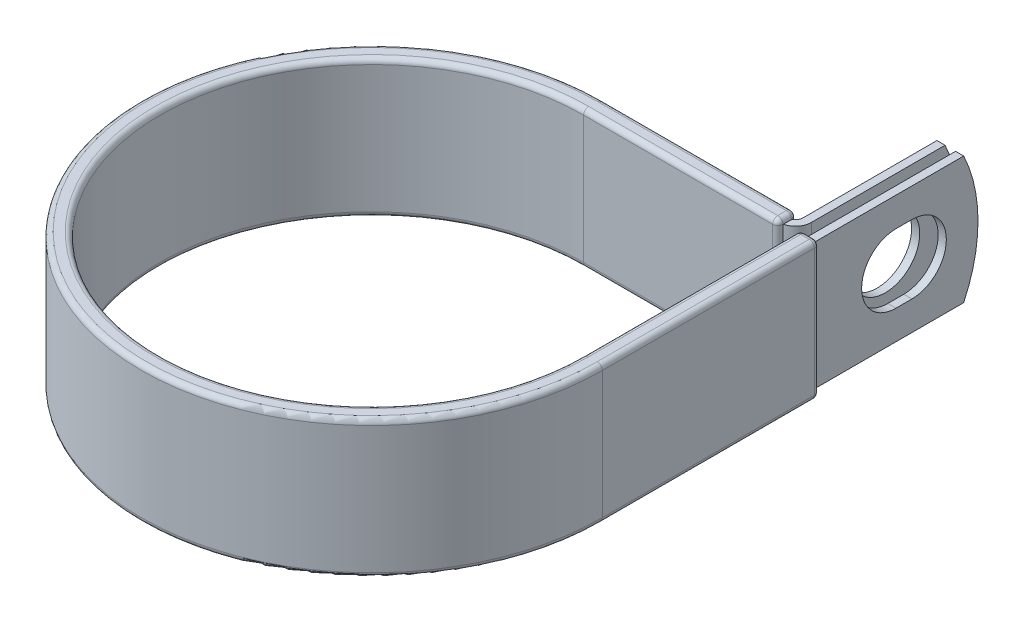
ISO-10303-21;
HEADER;
FILE_DESCRIPTION(('STEP AP214'),'2;1');
FILE_NAME('part.step','',(''),(''),'','','');
FILE_SCHEMA(('AUTOMOTIVE_DESIGN { 1 0 10303 214 1 1 1 1 }'));
ENDSEC;
DATA;
#1=APPLICATION_CONTEXT('core data for automotive mechanical design processes');
#2=APPLICATION_PROTOCOL_DEFINITION('international standard','automotive_design',2000,#1);
#3=PRODUCT_CONTEXT('',#1,'mechanical');
#4=PRODUCT('Part','Part','',(#3));
#5=PRODUCT_RELATED_PRODUCT_CATEGORY('part','',(#4));
#6=PRODUCT_DEFINITION_FORMATION('','',#4);
#7=PRODUCT_DEFINITION_CONTEXT('part definition',#1,'design');
#8=PRODUCT_DEFINITION('design','',#6,#7);
#9=PRODUCT_DEFINITION_SHAPE('','',#8);
#10=(LENGTH_UNIT() NAMED_UNIT(*) SI_UNIT(.MILLI.,.METRE.));
#11=(NAMED_UNIT(*) PLANE_ANGLE_UNIT() SI_UNIT($,.RADIAN.));
#12=(NAMED_UNIT(*) SI_UNIT($,.STERADIAN.) SOLID_ANGLE_UNIT());
#13=UNCERTAINTY_MEASURE_WITH_UNIT(LENGTH_MEASURE(1.E-05),#10,'distance_accuracy_value','');
#14=(GEOMETRIC_REPRESENTATION_CONTEXT(3) GLOBAL_UNCERTAINTY_ASSIGNED_CONTEXT((#13)) GLOBAL_UNIT_ASSIGNED_CONTEXT((#10,
#11,#12)) REPRESENTATION_CONTEXT('',''));
#15=CARTESIAN_POINT('',(0.,0.,0.));
#16=DIRECTION('',(0.,0.,1.));
#17=DIRECTION('',(1.,0.,0.));
#18=AXIS2_PLACEMENT_3D('',#15,#16,#17);
#19=CARTESIAN_POINT('',(30.96895,9.525,-57.1246));
#20=DIRECTION('',(1.,0.,0.));
#21=DIRECTION('',(0.,0.,-1.));
#22=AXIS2_PLACEMENT_3D('',#19,#20,#21);
#23=PLANE('',#22);
#24=CARTESIAN_POINT('',(30.96895,0.,-46.0248));
#25=DIRECTION('',(1.,0.,0.));
#26=DIRECTION('',(0.,0.,-1.));
#27=AXIS2_PLACEMENT_3D('',#24,#25,#26);
#28=CIRCLE('',#27,5.1562);
#29=CARTESIAN_POINT('',(30.96895,0.,-51.181));
#30=VERTEX_POINT('',#29);
#31=EDGE_CURVE('E460',#30,#30,#28,.F.);
#32=ORIENTED_EDGE('',*,*,#31,.T.);
#33=EDGE_LOOP('',(#32));
#34=FACE_BOUND('',#33,.T.);
#35=DIRECTION('',(0.,0.,1.));
#36=VECTOR('',#35,1.);
#37=CARTESIAN_POINT('',(30.96895,-9.525,-57.1246));
#38=LINE('',#37,#36);
#39=CARTESIAN_POINT('',(30.96895,-9.525,-54.9800631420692));
#40=VERTEX_POINT('',#39);
#41=CARTESIAN_POINT('',(30.96895,-9.525,-34.92119));
#42=VERTEX_POINT('',#41);
#43=EDGE_CURVE('E482',#40,#42,#38,.T.);
#44=ORIENTED_EDGE('',*,*,#43,.F.);
#45=CARTESIAN_POINT('',(30.96895,0.,-34.8996));
#46=DIRECTION('',(1.,0.,0.));
#47=DIRECTION('',(0.,0.,-1.));
#48=AXIS2_PLACEMENT_3D('',#45,#46,#47);
#49=CIRCLE('',#48,22.225);
#50=CARTESIAN_POINT('',(30.96895,9.525,-54.9800631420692));
#51=VERTEX_POINT('',#50);
#52=EDGE_CURVE('E419',#40,#51,#49,.T.);
#53=ORIENTED_EDGE('',*,*,#52,.T.);
#54=DIRECTION('',(0.,0.,1.));
#55=VECTOR('',#54,1.);
#56=CARTESIAN_POINT('',(30.96895,9.525,-57.1246));
#57=LINE('',#56,#55);
#58=CARTESIAN_POINT('',(30.96895,9.525,-34.92119));
#59=VERTEX_POINT('',#58);
#60=EDGE_CURVE('E472',#51,#59,#57,.T.);
#61=ORIENTED_EDGE('',*,*,#60,.T.);
#62=DIRECTION('',(0.,-1.,0.));
#63=VECTOR('',#62,1.);
#64=CARTESIAN_POINT('',(30.96895,9.525,-34.92119));
#65=LINE('',#64,#63);
#66=EDGE_CURVE('E489',#59,#42,#65,.T.);
#67=ORIENTED_EDGE('',*,*,#66,.T.);
#68=EDGE_LOOP('',(#44,#53,#61,#67));
#69=FACE_BOUND('',#68,.T.);
#70=ADVANCED_FACE('F54',(#34,#69),#23,.T.);
#71=CARTESIAN_POINT('',(29.74975,9.525,-57.1246));
#72=DIRECTION('',(1.,0.,0.));
#73=DIRECTION('',(0.,0.,-1.));
#74=AXIS2_PLACEMENT_3D('',#71,#72,#73);
#75=PLANE('',#74);
#76=CARTESIAN_POINT('',(29.74975,0.,-46.0248));
#77=DIRECTION('',(-1.,0.,0.));
#78=DIRECTION('',(0.,0.,1.));
#79=AXIS2_PLACEMENT_3D('',#76,#77,#78);
#80=CIRCLE('',#79,5.1562);
#81=CARTESIAN_POINT('',(29.74975,0.,-40.8686));
#82=VERTEX_POINT('',#81);
#83=EDGE_CURVE('E457',#82,#82,#80,.T.);
#84=ORIENTED_EDGE('',*,*,#83,.F.);
#85=EDGE_LOOP('',(#84));
#86=FACE_BOUND('',#85,.T.);
#87=CARTESIAN_POINT('',(29.74975,0.,-34.8996));
#88=DIRECTION('',(-1.,0.,0.));
#89=DIRECTION('',(0.,0.,1.));
#90=AXIS2_PLACEMENT_3D('',#87,#88,#89);
#91=CIRCLE('',#90,22.225);
#92=CARTESIAN_POINT('',(29.74975,9.525,-54.9800631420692));
#93=VERTEX_POINT('',#92);
#94=CARTESIAN_POINT('',(29.74975,-9.525,-54.9800631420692));
#95=VERTEX_POINT('',#94);
#96=EDGE_CURVE('E411',#93,#95,#91,.T.);
#97=ORIENTED_EDGE('',*,*,#96,.T.);
#98=DIRECTION('',(0.,0.,1.));
#99=VECTOR('',#98,1.);
#100=CARTESIAN_POINT('',(29.74975,-9.525,-57.1246));
#101=LINE('',#100,#99);
#102=CARTESIAN_POINT('',(29.74975,-9.525,-34.92119));
#103=VERTEX_POINT('',#102);
#104=EDGE_CURVE('E484',#95,#103,#101,.T.);
#105=ORIENTED_EDGE('',*,*,#104,.T.);
#106=DIRECTION('',(0.,-1.,0.));
#107=VECTOR('',#106,1.);
#108=CARTESIAN_POINT('',(29.74975,9.525,-34.92119));
#109=LINE('',#108,#107);
#110=CARTESIAN_POINT('',(29.74975,9.525,-34.92119));
#111=VERTEX_POINT('',#110);
#112=EDGE_CURVE('E477',#111,#103,#109,.T.);
#113=ORIENTED_EDGE('',*,*,#112,.F.);
#114=DIRECTION('',(0.,0.,1.));
#115=VECTOR('',#114,1.);
#116=CARTESIAN_POINT('',(29.74975,9.525,-57.1246));
#117=LINE('',#116,#115);
#118=EDGE_CURVE('E474',#93,#111,#117,.T.);
#119=ORIENTED_EDGE('',*,*,#118,.F.);
#120=EDGE_LOOP('',(#97,#105,#113,#119));
#121=FACE_BOUND('',#120,.T.);
#122=ADVANCED_FACE('F788',(#86,#121),#75,.F.);
#123=CARTESIAN_POINT('',(0.,-9.525,0.));
#124=DIRECTION('',(0.,1.,0.));
#125=DIRECTION('',(1.,0.,0.));
#126=AXIS2_PLACEMENT_3D('',#123,#124,#125);
#127=PLANE('',#126);
#128=CARTESIAN_POINT('',(28.59151,-9.525,-34.92119));
#129=DIRECTION('',(0.,-1.,0.));
#130=DIRECTION('',(0.,0.,1.));
#131=AXIS2_PLACEMENT_3D('',#128,#129,#130);
#132=CIRCLE('',#131,2.37744);
#133=CARTESIAN_POINT('',(29.1147500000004,-9.525,-32.6020434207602));
#134=VERTEX_POINT('',#133);
#135=EDGE_CURVE('E479',#42,#134,#132,.T.);
#136=ORIENTED_EDGE('',*,*,#135,.T.);
#137=DIRECTION('',(0.,0.,-1.));
#138=VECTOR('',#137,1.);
#139=CARTESIAN_POINT('',(29.1147500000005,-9.525,-33.76295));
#140=LINE('',#139,#138);
#141=CARTESIAN_POINT('',(29.1147500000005,-9.525,-33.7947));
#142=VERTEX_POINT('',#141);
#143=EDGE_CURVE('E368',#134,#142,#140,.T.);
#144=ORIENTED_EDGE('',*,*,#143,.T.);
#145=CARTESIAN_POINT('',(28.3527500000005,-9.525,-33.7947));
#146=DIRECTION('',(0.,1.,0.));
#147=DIRECTION('',(0.,0.,1.));
#148=AXIS2_PLACEMENT_3D('',#145,#146,#147);
#149=CIRCLE('',#148,0.762);
#150=CARTESIAN_POINT('',(29.109361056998,-9.525,-33.8851638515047));
#151=VERTEX_POINT('',#150);
#152=EDGE_CURVE('E554',#142,#151,#149,.T.);
#153=ORIENTED_EDGE('',*,*,#152,.T.);
#154=CARTESIAN_POINT('',(28.59151,-9.525,-34.92119));
#155=DIRECTION('',(0.,1.,0.));
#156=DIRECTION('',(1.,0.,0.));
#157=AXIS2_PLACEMENT_3D('',#154,#155,#156);
#158=CIRCLE('',#157,1.15824);
#159=EDGE_CURVE('E77',#103,#151,#158,.F.);
#160=ORIENTED_EDGE('',*,*,#159,.F.);
#161=ORIENTED_EDGE('',*,*,#104,.F.);
#162=DIRECTION('',(-1.,0.,0.));
#163=VECTOR('',#162,1.);
#164=CARTESIAN_POINT('',(33.76295,-9.525,-54.9800631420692));
#165=LINE('',#164,#163);
#166=EDGE_CURVE('E498',#40,#95,#165,.T.);
#167=ORIENTED_EDGE('',*,*,#166,.F.);
#168=ORIENTED_EDGE('',*,*,#43,.T.);
#169=EDGE_LOOP('',(#136,#144,#153,#160,#161,#167,#168));
#170=FACE_BOUND('',#169,.T.);
#171=ADVANCED_FACE('F794',(#170),#127,.F.);
#172=CARTESIAN_POINT('',(0.,9.525,0.));
#173=DIRECTION('',(0.,1.,0.));
#174=DIRECTION('',(1.,0.,0.));
#175=AXIS2_PLACEMENT_3D('',#172,#173,#174);
#176=PLANE('',#175);
#177=DIRECTION('',(0.,0.,-1.));
#178=VECTOR('',#177,1.);
#179=CARTESIAN_POINT('',(29.11475,9.525,4.08397189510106E-13));
#180=LINE('',#179,#178);
#181=CARTESIAN_POINT('',(29.1147500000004,9.525,-32.6020434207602));
#182=VERTEX_POINT('',#181);
#183=CARTESIAN_POINT('',(29.1147500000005,9.525,-33.7947));
#184=VERTEX_POINT('',#183);
#185=EDGE_CURVE('E405',#182,#184,#180,.T.);
#186=ORIENTED_EDGE('',*,*,#185,.F.);
#187=CARTESIAN_POINT('',(28.59151,9.525,-34.92119));
#188=DIRECTION('',(0.,-1.,0.));
#189=DIRECTION('',(0.,0.,1.));
#190=AXIS2_PLACEMENT_3D('',#187,#188,#189);
#191=CIRCLE('',#190,2.37744);
#192=EDGE_CURVE('E469',#59,#182,#191,.T.);
#193=ORIENTED_EDGE('',*,*,#192,.F.);
#194=ORIENTED_EDGE('',*,*,#60,.F.);
#195=DIRECTION('',(-1.,0.,0.));
#196=VECTOR('',#195,1.);
#197=CARTESIAN_POINT('',(33.76295,9.525,-54.9800631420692));
#198=LINE('',#197,#196);
#199=EDGE_CURVE('E495',#51,#93,#198,.T.);
#200=ORIENTED_EDGE('',*,*,#199,.T.);
#201=ORIENTED_EDGE('',*,*,#118,.T.);
#202=CARTESIAN_POINT('',(28.59151,9.525,-34.92119));
#203=DIRECTION('',(0.,1.,0.));
#204=DIRECTION('',(1.,0.,0.));
#205=AXIS2_PLACEMENT_3D('',#202,#203,#204);
#206=CIRCLE('',#205,1.15824);
#207=CARTESIAN_POINT('',(29.109361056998,9.525,-33.8851638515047));
#208=VERTEX_POINT('',#207);
#209=EDGE_CURVE('E70',#111,#208,#206,.F.);
#210=ORIENTED_EDGE('',*,*,#209,.T.);
#211=CARTESIAN_POINT('',(28.3527500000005,9.525,-33.7947));
#212=DIRECTION('',(0.,1.,0.));
#213=DIRECTION('',(0.,0.,1.));
#214=AXIS2_PLACEMENT_3D('',#211,#212,#213);
#215=CIRCLE('',#214,0.762);
#216=EDGE_CURVE('E12',#208,#184,#215,.F.);
#217=ORIENTED_EDGE('',*,*,#216,.T.);
#218=EDGE_LOOP('',(#186,#193,#194,#200,#201,#210,#217));
#219=FACE_BOUND('',#218,.T.);
#220=ADVANCED_FACE('F802',(#219),#176,.T.);
#221=CARTESIAN_POINT('',(28.59151,9.525,-34.92119));
#222=DIRECTION('',(0.,-1.,0.));
#223=DIRECTION('',(0.,0.,-1.));
#224=AXIS2_PLACEMENT_3D('',#221,#222,#223);
#225=CYLINDRICAL_SURFACE('',#224,2.37744);
#226=ORIENTED_EDGE('',*,*,#135,.F.);
#227=ORIENTED_EDGE('',*,*,#66,.F.);
#228=ORIENTED_EDGE('',*,*,#192,.T.);
#229=CARTESIAN_POINT('',(28.59151,9.525,-34.92119));
#230=DIRECTION('',(0.,-1.,0.));
#231=DIRECTION('',(0.,0.,-1.));
#232=AXIS2_PLACEMENT_3D('',#229,#230,#231);
#233=CIRCLE('',#232,2.37744);
#234=CARTESIAN_POINT('',(28.59151,9.525,-32.54375));
#235=VERTEX_POINT('',#234);
#236=EDGE_CURVE('E402',#235,#182,#233,.F.);
#237=ORIENTED_EDGE('',*,*,#236,.F.);
#238=DIRECTION('',(0.,-1.,0.));
#239=VECTOR('',#238,1.);
#240=CARTESIAN_POINT('',(28.59151,9.525,-32.54375));
#241=LINE('',#240,#239);
#242=CARTESIAN_POINT('',(28.59151,-9.52500000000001,-32.54375));
#243=VERTEX_POINT('',#242);
#244=EDGE_CURVE('E492',#235,#243,#241,.T.);
#245=ORIENTED_EDGE('',*,*,#244,.T.);
#246=CARTESIAN_POINT('',(28.59151,-9.52500000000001,-34.92119));
#247=DIRECTION('',(0.,1.,0.));
#248=DIRECTION('',(-1.,0.,0.));
#249=AXIS2_PLACEMENT_3D('',#246,#247,#248);
#250=CIRCLE('',#249,2.37744);
#251=EDGE_CURVE('E400',#134,#243,#250,.F.);
#252=ORIENTED_EDGE('',*,*,#251,.F.);
#253=EDGE_LOOP('',(#226,#227,#228,#237,#245,#252));
#254=FACE_BOUND('',#253,.T.);
#255=ADVANCED_FACE('F799',(#254),#225,.T.);
#256=CARTESIAN_POINT('',(28.59151,9.525,-34.92119));
#257=DIRECTION('',(0.,-1.,0.));
#258=DIRECTION('',(0.,0.,-1.));
#259=AXIS2_PLACEMENT_3D('',#256,#257,#258);
#260=CYLINDRICAL_SURFACE('',#259,1.15824);
#261=ORIENTED_EDGE('',*,*,#159,.T.);
#262=DIRECTION('',(0.,1.,0.));
#263=VECTOR('',#262,1.);
#264=CARTESIAN_POINT('',(29.109361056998,-9.525,-33.8851638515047));
#265=LINE('',#264,#263);
#266=EDGE_CURVE('E63',#151,#208,#265,.T.);
#267=ORIENTED_EDGE('',*,*,#266,.T.);
#268=ORIENTED_EDGE('',*,*,#209,.F.);
#269=ORIENTED_EDGE('',*,*,#112,.T.);
#270=EDGE_LOOP('',(#261,#267,#268,#269));
#271=FACE_BOUND('',#270,.T.);
#272=ADVANCED_FACE('F801',(#271),#260,.F.);
#273=CARTESIAN_POINT('',(45.5528859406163,0.,-46.0248));
#274=DIRECTION('',(-1.,0.,0.));
#275=DIRECTION('',(0.,0.,1.));
#276=AXIS2_PLACEMENT_3D('',#273,#274,#275);
#277=CYLINDRICAL_SURFACE('',#276,5.1562);
#278=ORIENTED_EDGE('',*,*,#83,.T.);
#279=EDGE_LOOP('',(#278));
#280=FACE_BOUND('',#279,.T.);
#281=ORIENTED_EDGE('',*,*,#31,.F.);
#282=EDGE_LOOP('',(#281));
#283=FACE_BOUND('',#282,.T.);
#284=ADVANCED_FACE('F808',(#280,#283),#277,.F.);
#285=CARTESIAN_POINT('',(33.76295,0.,-34.8996));
#286=DIRECTION('',(-1.,0.,0.));
#287=DIRECTION('',(0.,0.,1.));
#288=AXIS2_PLACEMENT_3D('',#285,#286,#287);
#289=CYLINDRICAL_SURFACE('',#288,22.225);
#290=ORIENTED_EDGE('',*,*,#52,.F.);
#291=ORIENTED_EDGE('',*,*,#166,.T.);
#292=ORIENTED_EDGE('',*,*,#96,.F.);
#293=ORIENTED_EDGE('',*,*,#199,.F.);
#294=EDGE_LOOP('',(#290,#291,#292,#293));
#295=FACE_BOUND('',#294,.T.);
#296=ADVANCED_FACE('F859',(#295),#289,.T.);
#297=CARTESIAN_POINT('',(4.56496313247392E-13,-9.525,-32.54375));
#298=DIRECTION('',(0.,0.,1.));
#299=DIRECTION('',(1.,0.,0.));
#300=AXIS2_PLACEMENT_3D('',#297,#298,#299);
#301=PLANE('',#300);
#302=DIRECTION('',(1.,0.,0.));
#303=VECTOR('',#302,1.);
#304=CARTESIAN_POINT('',(4.56496313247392E-13,-9.525,-32.54375));
#305=LINE('',#304,#303);
#306=CARTESIAN_POINT('',(29.1147500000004,-9.525,-32.54375));
#307=VERTEX_POINT('',#306);
#308=EDGE_CURVE('E375',#243,#307,#305,.T.);
#309=ORIENTED_EDGE('',*,*,#308,.F.);
#310=ORIENTED_EDGE('',*,*,#244,.F.);
#311=DIRECTION('',(1.,0.,0.));
#312=VECTOR('',#311,1.);
#313=CARTESIAN_POINT('',(4.56496313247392E-13,9.525,-32.54375));
#314=LINE('',#313,#312);
#315=CARTESIAN_POINT('',(29.1147500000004,9.525,-32.54375));
#316=VERTEX_POINT('',#315);
#317=EDGE_CURVE('E377',#235,#316,#314,.T.);
#318=ORIENTED_EDGE('',*,*,#317,.T.);
#319=DIRECTION('',(0.,-1.,0.));
#320=VECTOR('',#319,1.);
#321=CARTESIAN_POINT('',(29.1147500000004,-9.525,-32.54375));
#322=LINE('',#321,#320);
#323=EDGE_CURVE('E307',#316,#307,#322,.T.);
#324=ORIENTED_EDGE('',*,*,#323,.T.);
#325=EDGE_LOOP('',(#309,#310,#318,#324));
#326=FACE_BOUND('',#325,.T.);
#327=ADVANCED_FACE('F831',(#326),#301,.F.);
#328=CARTESIAN_POINT('',(29.1147500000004,-9.55675,-32.512));
#329=DIRECTION('',(1.,0.,0.));
#330=DIRECTION('',(0.,0.,-1.));
#331=AXIS2_PLACEMENT_3D('',#328,#329,#330);
#332=PLANE('',#331);
#333=DIRECTION('',(0.,0.,-1.));
#334=VECTOR('',#333,1.);
#335=CARTESIAN_POINT('',(29.1147500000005,-9.55675,-33.7947));
#336=LINE('',#335,#334);
#337=CARTESIAN_POINT('',(29.1147500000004,-9.55675,-32.512));
#338=VERTEX_POINT('',#337);
#339=CARTESIAN_POINT('',(29.1147500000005,-9.55675,-33.7947));
#340=VERTEX_POINT('',#339);
#341=EDGE_CURVE('E508',#338,#340,#336,.T.);
#342=ORIENTED_EDGE('',*,*,#341,.T.);
#343=DIRECTION('',(0.,1.,0.));
#344=VECTOR('',#343,1.);
#345=CARTESIAN_POINT('',(29.1147500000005,-9.55675,-33.7947));
#346=LINE('',#345,#344);
#347=EDGE_CURVE('E512',#340,#142,#346,.T.);
#348=ORIENTED_EDGE('',*,*,#347,.T.);
#349=ORIENTED_EDGE('',*,*,#143,.F.);
#350=EDGE_CURVE('E369',#307,#134,#140,.T.);
#351=ORIENTED_EDGE('',*,*,#350,.F.);
#352=ORIENTED_EDGE('',*,*,#323,.F.);
#353=DIRECTION('',(0.,0.,1.));
#354=VECTOR('',#353,1.);
#355=CARTESIAN_POINT('',(29.1147500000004,9.525,-32.54375));
#356=LINE('',#355,#354);
#357=EDGE_CURVE('E372',#182,#316,#356,.T.);
#358=ORIENTED_EDGE('',*,*,#357,.F.);
#359=ORIENTED_EDGE('',*,*,#185,.T.);
#360=DIRECTION('',(0.,1.,0.));
#361=VECTOR('',#360,1.);
#362=CARTESIAN_POINT('',(29.1147500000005,-9.55675,-33.7947));
#363=LINE('',#362,#361);
#364=CARTESIAN_POINT('',(29.1147500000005,9.55674999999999,-33.7947));
#365=VERTEX_POINT('',#364);
#366=EDGE_CURVE('E510',#184,#365,#363,.T.);
#367=ORIENTED_EDGE('',*,*,#366,.T.);
#368=DIRECTION('',(0.,0.,1.));
#369=VECTOR('',#368,1.);
#370=CARTESIAN_POINT('',(29.1147500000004,9.55674999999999,-32.512));
#371=LINE('',#370,#369);
#372=CARTESIAN_POINT('',(29.1147500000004,9.55674999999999,-32.512));
#373=VERTEX_POINT('',#372);
#374=EDGE_CURVE('E504',#365,#373,#371,.T.);
#375=ORIENTED_EDGE('',*,*,#374,.T.);
#376=DIRECTION('',(0.,-1.,0.));
#377=VECTOR('',#376,1.);
#378=CARTESIAN_POINT('',(29.1147500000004,-9.55675,-32.512));
#379=LINE('',#378,#377);
#380=EDGE_CURVE('E506',#373,#338,#379,.T.);
#381=ORIENTED_EDGE('',*,*,#380,.T.);
#382=EDGE_LOOP('',(#342,#348,#349,#351,#352,#358,#359,#367,#375,#381));
#383=FACE_BOUND('',#382,.T.);
#384=ADVANCED_FACE('F827',(#383),#332,.T.);
#385=CARTESIAN_POINT('',(4.74043586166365E-13,-9.55675,-33.7947));
#386=DIRECTION('',(1.,0.,0.));
#387=DIRECTION('',(0.,0.,-1.));
#388=AXIS2_PLACEMENT_3D('',#385,#386,#387);
#389=CYLINDRICAL_SURFACE('',#388,0.762000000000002);
#390=DIRECTION('',(1.,0.,0.));
#391=VECTOR('',#390,1.);
#392=CARTESIAN_POINT('',(4.84732280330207E-13,-9.55675,-34.5567));
#393=LINE('',#392,#391);
#394=CARTESIAN_POINT('',(4.84732280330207E-13,-9.55675,-34.5567));
#395=VERTEX_POINT('',#394);
#396=CARTESIAN_POINT('',(28.3527500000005,-9.55675,-34.5567));
#397=VERTEX_POINT('',#396);
#398=EDGE_CURVE('E394',#395,#397,#393,.T.);
#399=ORIENTED_EDGE('',*,*,#398,.T.);
#400=CARTESIAN_POINT('',(28.3527500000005,-9.55675,-33.7947));
#401=DIRECTION('',(1.,0.,0.));
#402=DIRECTION('',(0.,0.,-1.));
#403=AXIS2_PLACEMENT_3D('',#400,#401,#402);
#404=CIRCLE('',#403,0.762000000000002);
#405=CARTESIAN_POINT('',(28.3527500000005,-10.31875,-33.7947));
#406=VERTEX_POINT('',#405);
#407=EDGE_CURVE('E517',#397,#406,#404,.F.);
#408=ORIENTED_EDGE('',*,*,#407,.T.);
#409=DIRECTION('',(1.,0.,0.));
#410=VECTOR('',#409,1.);
#411=CARTESIAN_POINT('',(4.74043586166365E-13,-10.31875,-33.7947));
#412=LINE('',#411,#410);
#413=CARTESIAN_POINT('',(4.74043586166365E-13,-10.31875,-33.7947));
#414=VERTEX_POINT('',#413);
#415=EDGE_CURVE('E397',#414,#406,#412,.T.);
#416=ORIENTED_EDGE('',*,*,#415,.F.);
#417=CARTESIAN_POINT('',(4.74043586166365E-13,-9.55675,-33.7947));
#418=DIRECTION('',(1.,0.,0.));
#419=DIRECTION('',(0.,0.,1.));
#420=AXIS2_PLACEMENT_3D('',#417,#418,#419);
#421=CIRCLE('',#420,0.762000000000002);
#422=EDGE_CURVE('E345',#414,#395,#421,.T.);
#423=ORIENTED_EDGE('',*,*,#422,.T.);
#424=EDGE_LOOP('',(#399,#408,#416,#423));
#425=FACE_BOUND('',#424,.T.);
#426=ADVANCED_FACE('F670',(#425),#389,.T.);
#427=CARTESIAN_POINT('',(4.84732280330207E-13,9.55675,-34.5567));
#428=DIRECTION('',(0.,0.,-1.));
#429=DIRECTION('',(0.,1.,0.));
#430=AXIS2_PLACEMENT_3D('',#427,#428,#429);
#431=PLANE('',#430);
#432=DIRECTION('',(1.,0.,0.));
#433=VECTOR('',#432,1.);
#434=CARTESIAN_POINT('',(4.84732280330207E-13,9.55675,-34.5567));
#435=LINE('',#434,#433);
#436=CARTESIAN_POINT('',(4.84732280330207E-13,9.55675,-34.5567));
#437=VERTEX_POINT('',#436);
#438=CARTESIAN_POINT('',(28.3527500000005,9.55675,-34.5567));
#439=VERTEX_POINT('',#438);
#440=EDGE_CURVE('E391',#437,#439,#435,.T.);
#441=ORIENTED_EDGE('',*,*,#440,.T.);
#442=DIRECTION('',(0.,1.,0.));
#443=VECTOR('',#442,1.);
#444=CARTESIAN_POINT('',(28.3527500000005,9.55675,-34.5567));
#445=LINE('',#444,#443);
#446=EDGE_CURVE('E515',#439,#397,#445,.F.);
#447=ORIENTED_EDGE('',*,*,#446,.T.);
#448=ORIENTED_EDGE('',*,*,#398,.F.);
#449=DIRECTION('',(0.,1.,0.));
#450=VECTOR('',#449,1.);
#451=CARTESIAN_POINT('',(4.84732280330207E-13,9.55675,-34.5567));
#452=LINE('',#451,#450);
#453=EDGE_CURVE('E342',#395,#437,#452,.T.);
#454=ORIENTED_EDGE('',*,*,#453,.T.);
#455=EDGE_LOOP('',(#441,#447,#448,#454));
#456=FACE_BOUND('',#455,.T.);
#457=ADVANCED_FACE('F676',(#456),#431,.T.);
#458=CARTESIAN_POINT('',(4.74043586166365E-13,9.55675,-33.7947));
#459=DIRECTION('',(1.,0.,0.));
#460=DIRECTION('',(0.,0.,-1.));
#461=AXIS2_PLACEMENT_3D('',#458,#459,#460);
#462=CYLINDRICAL_SURFACE('',#461,0.762000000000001);
#463=DIRECTION('',(1.,0.,0.));
#464=VECTOR('',#463,1.);
#465=CARTESIAN_POINT('',(4.74043586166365E-13,10.31875,-33.7947));
#466=LINE('',#465,#464);
#467=CARTESIAN_POINT('',(4.74043586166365E-13,10.31875,-33.7947));
#468=VERTEX_POINT('',#467);
#469=CARTESIAN_POINT('',(28.3527500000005,10.31875,-33.7947));
#470=VERTEX_POINT('',#469);
#471=EDGE_CURVE('E388',#468,#470,#466,.T.);
#472=ORIENTED_EDGE('',*,*,#471,.T.);
#473=CARTESIAN_POINT('',(28.3527500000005,9.55675,-33.7947));
#474=DIRECTION('',(1.,0.,0.));
#475=DIRECTION('',(0.,0.,-1.));
#476=AXIS2_PLACEMENT_3D('',#473,#474,#475);
#477=CIRCLE('',#476,0.762000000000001);
#478=EDGE_CURVE('E501',#470,#439,#477,.F.);
#479=ORIENTED_EDGE('',*,*,#478,.T.);
#480=ORIENTED_EDGE('',*,*,#440,.F.);
#481=CARTESIAN_POINT('',(4.74043586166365E-13,9.55675,-33.7947));
#482=DIRECTION('',(1.,0.,0.));
#483=DIRECTION('',(0.,0.,1.));
#484=AXIS2_PLACEMENT_3D('',#481,#482,#483);
#485=CIRCLE('',#484,0.762000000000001);
#486=EDGE_CURVE('E339',#437,#468,#485,.T.);
#487=ORIENTED_EDGE('',*,*,#486,.T.);
#488=EDGE_LOOP('',(#472,#479,#480,#487));
#489=FACE_BOUND('',#488,.T.);
#490=ADVANCED_FACE('F680',(#489),#462,.T.);
#491=CARTESIAN_POINT('',(4.56050950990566E-13,9.55675,-32.512));
#492=DIRECTION('',(1.,0.,0.));
#493=DIRECTION('',(0.,0.,-1.));
#494=AXIS2_PLACEMENT_3D('',#491,#492,#493);
#495=CYLINDRICAL_SURFACE('',#494,0.762);
#496=DIRECTION('',(1.,0.,0.));
#497=VECTOR('',#496,1.);
#498=CARTESIAN_POINT('',(4.45362256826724E-13,9.55675,-31.75));
#499=LINE('',#498,#497);
#500=CARTESIAN_POINT('',(4.45362256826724E-13,9.55675,-31.75));
#501=VERTEX_POINT('',#500);
#502=CARTESIAN_POINT('',(28.3527500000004,9.55675,-31.75));
#503=VERTEX_POINT('',#502);
#504=EDGE_CURVE('E382',#501,#503,#499,.T.);
#505=ORIENTED_EDGE('',*,*,#504,.T.);
#506=CARTESIAN_POINT('',(28.3527500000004,9.55675,-32.512));
#507=DIRECTION('',(1.,0.,0.));
#508=DIRECTION('',(0.,0.,-1.));
#509=AXIS2_PLACEMENT_3D('',#506,#507,#508);
#510=CIRCLE('',#509,0.762);
#511=CARTESIAN_POINT('',(28.3527500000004,10.31875,-32.512));
#512=VERTEX_POINT('',#511);
#513=EDGE_CURVE('E527',#503,#512,#510,.F.);
#514=ORIENTED_EDGE('',*,*,#513,.T.);
#515=DIRECTION('',(1.,0.,0.));
#516=VECTOR('',#515,1.);
#517=CARTESIAN_POINT('',(4.56050950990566E-13,10.31875,-32.512));
#518=LINE('',#517,#516);
#519=CARTESIAN_POINT('',(4.56050950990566E-13,10.31875,-32.512));
#520=VERTEX_POINT('',#519);
#521=EDGE_CURVE('E385',#520,#512,#518,.T.);
#522=ORIENTED_EDGE('',*,*,#521,.F.);
#523=CARTESIAN_POINT('',(4.56050950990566E-13,9.55675,-32.512));
#524=DIRECTION('',(1.,0.,0.));
#525=DIRECTION('',(0.,0.,1.));
#526=AXIS2_PLACEMENT_3D('',#523,#524,#525);
#527=CIRCLE('',#526,0.762);
#528=EDGE_CURVE('E336',#520,#501,#527,.T.);
#529=ORIENTED_EDGE('',*,*,#528,.T.);
#530=EDGE_LOOP('',(#505,#514,#522,#529));
#531=FACE_BOUND('',#530,.T.);
#532=ADVANCED_FACE('F721',(#531),#495,.T.);
#533=CARTESIAN_POINT('',(4.45362256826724E-13,-9.55675,-31.75));
#534=DIRECTION('',(0.,0.,1.));
#535=DIRECTION('',(1.,0.,0.));
#536=AXIS2_PLACEMENT_3D('',#533,#534,#535);
#537=PLANE('',#536);
#538=DIRECTION('',(1.,0.,0.));
#539=VECTOR('',#538,1.);
#540=CARTESIAN_POINT('',(4.45362256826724E-13,-9.55675,-31.75));
#541=LINE('',#540,#539);
#542=CARTESIAN_POINT('',(4.45362256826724E-13,-9.55675,-31.75));
#543=VERTEX_POINT('',#542);
#544=CARTESIAN_POINT('',(28.3527500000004,-9.55675,-31.75));
#545=VERTEX_POINT('',#544);
#546=EDGE_CURVE('E379',#543,#545,#541,.T.);
#547=ORIENTED_EDGE('',*,*,#546,.T.);
#548=DIRECTION('',(0.,-1.,0.));
#549=VECTOR('',#548,1.);
#550=CARTESIAN_POINT('',(28.3527500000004,-9.55675,-31.75));
#551=LINE('',#550,#549);
#552=EDGE_CURVE('E525',#545,#503,#551,.F.);
#553=ORIENTED_EDGE('',*,*,#552,.T.);
#554=ORIENTED_EDGE('',*,*,#504,.F.);
#555=DIRECTION('',(0.,-1.,0.));
#556=VECTOR('',#555,1.);
#557=CARTESIAN_POINT('',(4.45362256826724E-13,-9.55675,-31.75));
#558=LINE('',#557,#556);
#559=EDGE_CURVE('E327',#501,#543,#558,.T.);
#560=ORIENTED_EDGE('',*,*,#559,.T.);
#561=EDGE_LOOP('',(#547,#553,#554,#560));
#562=FACE_BOUND('',#561,.T.);
#563=ADVANCED_FACE('F719',(#562),#537,.T.);
#564=CARTESIAN_POINT('',(4.56050950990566E-13,-9.55675,-32.512));
#565=DIRECTION('',(1.,0.,0.));
#566=DIRECTION('',(0.,0.,-1.));
#567=AXIS2_PLACEMENT_3D('',#564,#565,#566);
#568=CYLINDRICAL_SURFACE('',#567,0.761999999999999);
#569=DIRECTION('',(1.,0.,0.));
#570=VECTOR('',#569,1.);
#571=CARTESIAN_POINT('',(4.56050950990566E-13,-10.31875,-32.512));
#572=LINE('',#571,#570);
#573=CARTESIAN_POINT('',(4.56050950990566E-13,-10.31875,-32.512));
#574=VERTEX_POINT('',#573);
#575=CARTESIAN_POINT('',(28.3527500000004,-10.31875,-32.512));
#576=VERTEX_POINT('',#575);
#577=EDGE_CURVE('E303',#574,#576,#572,.T.);
#578=ORIENTED_EDGE('',*,*,#577,.T.);
#579=CARTESIAN_POINT('',(28.3527500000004,-9.55675,-32.512));
#580=DIRECTION('',(1.,0.,0.));
#581=DIRECTION('',(0.,0.,-1.));
#582=AXIS2_PLACEMENT_3D('',#579,#580,#581);
#583=CIRCLE('',#582,0.761999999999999);
#584=EDGE_CURVE('E523',#576,#545,#583,.F.);
#585=ORIENTED_EDGE('',*,*,#584,.T.);
#586=ORIENTED_EDGE('',*,*,#546,.F.);
#587=CARTESIAN_POINT('',(4.56050950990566E-13,-9.55675,-32.512));
#588=DIRECTION('',(1.,0.,0.));
#589=DIRECTION('',(0.,0.,-1.));
#590=AXIS2_PLACEMENT_3D('',#587,#588,#589);
#591=CIRCLE('',#590,0.761999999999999);
#592=EDGE_CURVE('E324',#543,#574,#591,.T.);
#593=ORIENTED_EDGE('',*,*,#592,.T.);
#594=EDGE_LOOP('',(#578,#585,#586,#593));
#595=FACE_BOUND('',#594,.T.);
#596=ADVANCED_FACE('F709',(#595),#568,.T.);
#597=CARTESIAN_POINT('',(0.,-9.55675,0.));
#598=DIRECTION('',(0.,-1.,0.));
#599=DIRECTION('',(0.,0.,-1.));
#600=AXIS2_PLACEMENT_3D('',#597,#598,#599);
#601=TOROIDAL_SURFACE('',#600,33.7947,0.762000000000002);
#602=CARTESIAN_POINT('',(33.7947,-9.55675,0.));
#603=DIRECTION('',(0.,0.,1.));
#604=DIRECTION('',(-1.,0.,0.));
#605=AXIS2_PLACEMENT_3D('',#602,#603,#604);
#606=CIRCLE('',#605,0.762000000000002);
#607=CARTESIAN_POINT('',(33.7947,-10.31875,0.));
#608=VERTEX_POINT('',#607);
#609=CARTESIAN_POINT('',(34.5567,-9.55675,0.));
#610=VERTEX_POINT('',#609);
#611=EDGE_CURVE('E318',#608,#610,#606,.T.);
#612=ORIENTED_EDGE('',*,*,#611,.T.);
#613=CARTESIAN_POINT('',(0.,-9.55675,0.));
#614=DIRECTION('',(0.,-1.,0.));
#615=DIRECTION('',(0.,0.,-1.));
#616=AXIS2_PLACEMENT_3D('',#613,#614,#615);
#617=CIRCLE('',#616,34.5567);
#618=EDGE_CURVE('E361',#610,#395,#617,.T.);
#619=ORIENTED_EDGE('',*,*,#618,.T.);
#620=ORIENTED_EDGE('',*,*,#422,.F.);
#621=CARTESIAN_POINT('',(0.,-10.31875,0.));
#622=DIRECTION('',(0.,-1.,0.));
#623=DIRECTION('',(0.,0.,-1.));
#624=AXIS2_PLACEMENT_3D('',#621,#622,#623);
#625=CIRCLE('',#624,33.7947);
#626=EDGE_CURVE('E308',#608,#414,#625,.T.);
#627=ORIENTED_EDGE('',*,*,#626,.F.);
#628=EDGE_LOOP('',(#612,#619,#620,#627));
#629=FACE_BOUND('',#628,.T.);
#630=ADVANCED_FACE('F667',(#629),#601,.T.);
#631=CARTESIAN_POINT('',(0.,9.525,0.));
#632=DIRECTION('',(0.,-1.,0.));
#633=DIRECTION('',(0.,0.,-1.));
#634=AXIS2_PLACEMENT_3D('',#631,#632,#633);
#635=CYLINDRICAL_SURFACE('',#634,34.5567);
#636=DIRECTION('',(0.,1.,0.));
#637=VECTOR('',#636,1.);
#638=CARTESIAN_POINT('',(34.5567,9.55675,0.));
#639=LINE('',#638,#637);
#640=CARTESIAN_POINT('',(34.5567,9.55675,0.));
#641=VERTEX_POINT('',#640);
#642=EDGE_CURVE('E655',#610,#641,#639,.T.);
#643=ORIENTED_EDGE('',*,*,#642,.T.);
#644=CARTESIAN_POINT('',(0.,9.55675,0.));
#645=DIRECTION('',(0.,-1.,0.));
#646=DIRECTION('',(0.,0.,-1.));
#647=AXIS2_PLACEMENT_3D('',#644,#645,#646);
#648=CIRCLE('',#647,34.5567);
#649=EDGE_CURVE('E358',#641,#437,#648,.T.);
#650=ORIENTED_EDGE('',*,*,#649,.T.);
#651=ORIENTED_EDGE('',*,*,#453,.F.);
#652=ORIENTED_EDGE('',*,*,#618,.F.);
#653=EDGE_LOOP('',(#643,#650,#651,#652));
#654=FACE_BOUND('',#653,.T.);
#655=ADVANCED_FACE('F673',(#654),#635,.T.);
#656=CARTESIAN_POINT('',(0.,9.55675,0.));
#657=DIRECTION('',(0.,-1.,0.));
#658=DIRECTION('',(0.,0.,-1.));
#659=AXIS2_PLACEMENT_3D('',#656,#657,#658);
#660=TOROIDAL_SURFACE('',#659,33.7947,0.762000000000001);
#661=CARTESIAN_POINT('',(33.7947,9.55675,0.));
#662=DIRECTION('',(0.,0.,1.));
#663=DIRECTION('',(-1.,0.,0.));
#664=AXIS2_PLACEMENT_3D('',#661,#662,#663);
#665=CIRCLE('',#664,0.762000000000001);
#666=CARTESIAN_POINT('',(33.7947,10.31875,0.));
#667=VERTEX_POINT('',#666);
#668=EDGE_CURVE('E734',#641,#667,#665,.T.);
#669=ORIENTED_EDGE('',*,*,#668,.T.);
#670=CARTESIAN_POINT('',(0.,10.31875,0.));
#671=DIRECTION('',(0.,-1.,0.));
#672=DIRECTION('',(0.,0.,-1.));
#673=AXIS2_PLACEMENT_3D('',#670,#671,#672);
#674=CIRCLE('',#673,33.7947);
#675=EDGE_CURVE('E355',#667,#468,#674,.T.);
#676=ORIENTED_EDGE('',*,*,#675,.T.);
#677=ORIENTED_EDGE('',*,*,#486,.F.);
#678=ORIENTED_EDGE('',*,*,#649,.F.);
#679=EDGE_LOOP('',(#669,#676,#677,#678));
#680=FACE_BOUND('',#679,.T.);
#681=ADVANCED_FACE('F678',(#680),#660,.T.);
#682=CARTESIAN_POINT('',(0.,9.55675,0.));
#683=DIRECTION('',(0.,-1.,0.));
#684=DIRECTION('',(0.,0.,-1.));
#685=AXIS2_PLACEMENT_3D('',#682,#683,#684);
#686=TOROIDAL_SURFACE('',#685,32.512,0.762);
#687=CARTESIAN_POINT('',(32.512,9.55675,0.));
#688=DIRECTION('',(0.,0.,1.));
#689=DIRECTION('',(-1.,0.,0.));
#690=AXIS2_PLACEMENT_3D('',#687,#688,#689);
#691=CIRCLE('',#690,0.762);
#692=CARTESIAN_POINT('',(32.512,10.31875,0.));
#693=VERTEX_POINT('',#692);
#694=CARTESIAN_POINT('',(31.75,9.55675,0.));
#695=VERTEX_POINT('',#694);
#696=EDGE_CURVE('E730',#693,#695,#691,.T.);
#697=ORIENTED_EDGE('',*,*,#696,.T.);
#698=CARTESIAN_POINT('',(0.,9.55675,0.));
#699=DIRECTION('',(0.,-1.,0.));
#700=DIRECTION('',(0.,0.,-1.));
#701=AXIS2_PLACEMENT_3D('',#698,#699,#700);
#702=CIRCLE('',#701,31.75);
#703=EDGE_CURVE('E349',#695,#501,#702,.T.);
#704=ORIENTED_EDGE('',*,*,#703,.T.);
#705=ORIENTED_EDGE('',*,*,#528,.F.);
#706=CARTESIAN_POINT('',(0.,10.31875,0.));
#707=DIRECTION('',(0.,-1.,0.));
#708=DIRECTION('',(0.,0.,-1.));
#709=AXIS2_PLACEMENT_3D('',#706,#707,#708);
#710=CIRCLE('',#709,32.512);
#711=EDGE_CURVE('E352',#693,#520,#710,.T.);
#712=ORIENTED_EDGE('',*,*,#711,.F.);
#713=EDGE_LOOP('',(#697,#704,#705,#712));
#714=FACE_BOUND('',#713,.T.);
#715=ADVANCED_FACE('F728',(#714),#686,.T.);
#716=CARTESIAN_POINT('',(0.,9.525,0.));
#717=DIRECTION('',(0.,-1.,0.));
#718=DIRECTION('',(0.,0.,-1.));
#719=AXIS2_PLACEMENT_3D('',#716,#717,#718);
#720=CYLINDRICAL_SURFACE('',#719,31.75);
#721=DIRECTION('',(0.,-1.,0.));
#722=VECTOR('',#721,1.);
#723=CARTESIAN_POINT('',(31.75,-9.55675,0.));
#724=LINE('',#723,#722);
#725=CARTESIAN_POINT('',(31.75,-9.55675,0.));
#726=VERTEX_POINT('',#725);
#727=EDGE_CURVE('E733',#695,#726,#724,.T.);
#728=ORIENTED_EDGE('',*,*,#727,.T.);
#729=CARTESIAN_POINT('',(0.,-9.55675,0.));
#730=DIRECTION('',(0.,-1.,0.));
#731=DIRECTION('',(0.,0.,-1.));
#732=AXIS2_PLACEMENT_3D('',#729,#730,#731);
#733=CIRCLE('',#732,31.75);
#734=EDGE_CURVE('E314',#726,#543,#733,.T.);
#735=ORIENTED_EDGE('',*,*,#734,.T.);
#736=ORIENTED_EDGE('',*,*,#559,.F.);
#737=ORIENTED_EDGE('',*,*,#703,.F.);
#738=EDGE_LOOP('',(#728,#735,#736,#737));
#739=FACE_BOUND('',#738,.T.);
#740=ADVANCED_FACE('F726',(#739),#720,.F.);
#741=CARTESIAN_POINT('',(0.,-9.55675,0.));
#742=DIRECTION('',(0.,-1.,0.));
#743=DIRECTION('',(0.,0.,-1.));
#744=AXIS2_PLACEMENT_3D('',#741,#742,#743);
#745=TOROIDAL_SURFACE('',#744,32.512,0.761999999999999);
#746=CARTESIAN_POINT('',(32.512,-9.55675,0.));
#747=DIRECTION('',(0.,0.,1.));
#748=DIRECTION('',(1.,0.,0.));
#749=AXIS2_PLACEMENT_3D('',#746,#747,#748);
#750=CIRCLE('',#749,0.761999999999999);
#751=CARTESIAN_POINT('',(32.512,-10.31875,0.));
#752=VERTEX_POINT('',#751);
#753=EDGE_CURVE('E311',#726,#752,#750,.T.);
#754=ORIENTED_EDGE('',*,*,#753,.T.);
#755=CARTESIAN_POINT('',(0.,-10.31875,0.));
#756=DIRECTION('',(0.,-1.,0.));
#757=DIRECTION('',(0.,0.,-1.));
#758=AXIS2_PLACEMENT_3D('',#755,#756,#757);
#759=CIRCLE('',#758,32.512);
#760=EDGE_CURVE('E295',#752,#574,#759,.T.);
#761=ORIENTED_EDGE('',*,*,#760,.T.);
#762=ORIENTED_EDGE('',*,*,#592,.F.);
#763=ORIENTED_EDGE('',*,*,#734,.F.);
#764=EDGE_LOOP('',(#754,#761,#762,#763));
#765=FACE_BOUND('',#764,.T.);
#766=ADVANCED_FACE('F312',(#765),#745,.T.);
#767=CARTESIAN_POINT('',(32.512,-9.55675,0.));
#768=DIRECTION('',(0.,0.,-1.));
#769=DIRECTION('',(-1.,0.,0.));
#770=AXIS2_PLACEMENT_3D('',#767,#768,#769);
#771=CYLINDRICAL_SURFACE('',#770,0.761999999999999);
#772=DIRECTION('',(0.,0.,-1.));
#773=VECTOR('',#772,1.);
#774=CARTESIAN_POINT('',(31.75,-9.55675,0.));
#775=LINE('',#774,#773);
#776=CARTESIAN_POINT('',(31.75,-9.55675,-31.78175));
#777=VERTEX_POINT('',#776);
#778=EDGE_CURVE('E741',#726,#777,#775,.T.);
#779=ORIENTED_EDGE('',*,*,#778,.T.);
#780=CARTESIAN_POINT('',(32.512,-9.55675,-31.78175));
#781=DIRECTION('',(0.,0.,-1.));
#782=DIRECTION('',(-1.,0.,0.));
#783=AXIS2_PLACEMENT_3D('',#780,#781,#782);
#784=CIRCLE('',#783,0.761999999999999);
#785=CARTESIAN_POINT('',(32.512,-10.31875,-31.78175));
#786=VERTEX_POINT('',#785);
#787=EDGE_CURVE('E323',#777,#786,#784,.F.);
#788=ORIENTED_EDGE('',*,*,#787,.T.);
#789=DIRECTION('',(0.,0.,-1.));
#790=VECTOR('',#789,1.);
#791=CARTESIAN_POINT('',(32.512,-10.31875,0.));
#792=LINE('',#791,#790);
#793=EDGE_CURVE('E300',#752,#786,#792,.T.);
#794=ORIENTED_EDGE('',*,*,#793,.F.);
#795=ORIENTED_EDGE('',*,*,#753,.F.);
#796=EDGE_LOOP('',(#779,#788,#794,#795));
#797=FACE_BOUND('',#796,.T.);
#798=ADVANCED_FACE('F321',(#797),#771,.T.);
#799=CARTESIAN_POINT('',(33.7947,-10.31875,0.));
#800=DIRECTION('',(0.,1.,0.));
#801=DIRECTION('',(0.,0.,1.));
#802=AXIS2_PLACEMENT_3D('',#799,#800,#801);
#803=PLANE('',#802);
#804=ORIENTED_EDGE('',*,*,#415,.T.);
#805=DIRECTION('',(0.,0.,-1.));
#806=VECTOR('',#805,1.);
#807=CARTESIAN_POINT('',(28.3527500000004,-10.31875,-32.512));
#808=LINE('',#807,#806);
#809=EDGE_CURVE('E521',#406,#576,#808,.F.);
#810=ORIENTED_EDGE('',*,*,#809,.T.);
#811=ORIENTED_EDGE('',*,*,#577,.F.);
#812=ORIENTED_EDGE('',*,*,#760,.F.);
#813=ORIENTED_EDGE('',*,*,#793,.T.);
#814=DIRECTION('',(1.,0.,0.));
#815=VECTOR('',#814,1.);
#816=CARTESIAN_POINT('',(33.7947,-10.31875,-31.78175));
#817=LINE('',#816,#815);
#818=CARTESIAN_POINT('',(33.7947,-10.31875,-31.78175));
#819=VERTEX_POINT('',#818);
#820=EDGE_CURVE('E519',#786,#819,#817,.T.);
#821=ORIENTED_EDGE('',*,*,#820,.T.);
#822=DIRECTION('',(0.,0.,-1.));
#823=VECTOR('',#822,1.);
#824=CARTESIAN_POINT('',(33.7947,-10.31875,0.));
#825=LINE('',#824,#823);
#826=EDGE_CURVE('E325',#608,#819,#825,.T.);
#827=ORIENTED_EDGE('',*,*,#826,.F.);
#828=ORIENTED_EDGE('',*,*,#626,.T.);
#829=EDGE_LOOP('',(#804,#810,#811,#812,#813,#821,#827,#828));
#830=FACE_BOUND('',#829,.T.);
#831=ADVANCED_FACE('F298',(#830),#803,.F.);
#832=CARTESIAN_POINT('',(33.7947,-9.55675,0.));
#833=DIRECTION('',(0.,0.,-1.));
#834=DIRECTION('',(-1.,0.,0.));
#835=AXIS2_PLACEMENT_3D('',#832,#833,#834);
#836=CYLINDRICAL_SURFACE('',#835,0.762000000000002);
#837=ORIENTED_EDGE('',*,*,#826,.T.);
#838=CARTESIAN_POINT('',(33.7947,-9.55675,-31.78175));
#839=DIRECTION('',(0.,0.,-1.));
#840=DIRECTION('',(-1.,0.,0.));
#841=AXIS2_PLACEMENT_3D('',#838,#839,#840);
#842=CIRCLE('',#841,0.762000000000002);
#843=CARTESIAN_POINT('',(34.5567,-9.55675,-31.78175));
#844=VERTEX_POINT('',#843);
#845=EDGE_CURVE('E543',#819,#844,#842,.F.);
#846=ORIENTED_EDGE('',*,*,#845,.T.);
#847=DIRECTION('',(0.,0.,-1.));
#848=VECTOR('',#847,1.);
#849=CARTESIAN_POINT('',(34.5567,-9.55675,0.));
#850=LINE('',#849,#848);
#851=EDGE_CURVE('E330',#610,#844,#850,.T.);
#852=ORIENTED_EDGE('',*,*,#851,.F.);
#853=ORIENTED_EDGE('',*,*,#611,.F.);
#854=EDGE_LOOP('',(#837,#846,#852,#853));
#855=FACE_BOUND('',#854,.T.);
#856=ADVANCED_FACE('F661',(#855),#836,.T.);
#857=CARTESIAN_POINT('',(34.5567,9.55675,0.));
#858=DIRECTION('',(-1.,0.,0.));
#859=DIRECTION('',(0.,-1.,0.));
#860=AXIS2_PLACEMENT_3D('',#857,#858,#859);
#861=PLANE('',#860);
#862=ORIENTED_EDGE('',*,*,#851,.T.);
#863=DIRECTION('',(0.,1.,0.));
#864=VECTOR('',#863,1.);
#865=CARTESIAN_POINT('',(34.5567,9.55675,-31.78175));
#866=LINE('',#865,#864);
#867=CARTESIAN_POINT('',(34.5567,9.55675,-31.78175));
#868=VERTEX_POINT('',#867);
#869=EDGE_CURVE('E532',#844,#868,#866,.T.);
#870=ORIENTED_EDGE('',*,*,#869,.T.);
#871=DIRECTION('',(0.,0.,-1.));
#872=VECTOR('',#871,1.);
#873=CARTESIAN_POINT('',(34.5567,9.55675,0.));
#874=LINE('',#873,#872);
#875=EDGE_CURVE('E640',#641,#868,#874,.T.);
#876=ORIENTED_EDGE('',*,*,#875,.F.);
#877=ORIENTED_EDGE('',*,*,#642,.F.);
#878=EDGE_LOOP('',(#862,#870,#876,#877));
#879=FACE_BOUND('',#878,.T.);
#880=ADVANCED_FACE('F653',(#879),#861,.F.);
#881=CARTESIAN_POINT('',(33.7947,9.55675,0.));
#882=DIRECTION('',(0.,0.,-1.));
#883=DIRECTION('',(-1.,0.,0.));
#884=AXIS2_PLACEMENT_3D('',#881,#882,#883);
#885=CYLINDRICAL_SURFACE('',#884,0.762000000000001);
#886=ORIENTED_EDGE('',*,*,#875,.T.);
#887=CARTESIAN_POINT('',(33.7947,9.55675,-31.78175));
#888=DIRECTION('',(0.,0.,-1.));
#889=DIRECTION('',(-1.,0.,0.));
#890=AXIS2_PLACEMENT_3D('',#887,#888,#889);
#891=CIRCLE('',#890,0.762000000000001);
#892=CARTESIAN_POINT('',(33.7947,10.31875,-31.78175));
#893=VERTEX_POINT('',#892);
#894=EDGE_CURVE('E529',#868,#893,#891,.F.);
#895=ORIENTED_EDGE('',*,*,#894,.T.);
#896=DIRECTION('',(0.,0.,-1.));
#897=VECTOR('',#896,1.);
#898=CARTESIAN_POINT('',(33.7947,10.31875,0.));
#899=LINE('',#898,#897);
#900=EDGE_CURVE('E638',#667,#893,#899,.T.);
#901=ORIENTED_EDGE('',*,*,#900,.F.);
#902=ORIENTED_EDGE('',*,*,#668,.F.);
#903=EDGE_LOOP('',(#886,#895,#901,#902));
#904=FACE_BOUND('',#903,.T.);
#905=ADVANCED_FACE('F636',(#904),#885,.T.);
#906=CARTESIAN_POINT('',(32.512,10.31875,0.));
#907=DIRECTION('',(0.,-1.,0.));
#908=DIRECTION('',(1.,0.,0.));
#909=AXIS2_PLACEMENT_3D('',#906,#907,#908);
#910=PLANE('',#909);
#911=ORIENTED_EDGE('',*,*,#521,.T.);
#912=DIRECTION('',(0.,0.,1.));
#913=VECTOR('',#912,1.);
#914=CARTESIAN_POINT('',(28.3527500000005,10.31875,-33.7947));
#915=LINE('',#914,#913);
#916=EDGE_CURVE('E552',#512,#470,#915,.F.);
#917=ORIENTED_EDGE('',*,*,#916,.T.);
#918=ORIENTED_EDGE('',*,*,#471,.F.);
#919=ORIENTED_EDGE('',*,*,#675,.F.);
#920=ORIENTED_EDGE('',*,*,#900,.T.);
#921=DIRECTION('',(-1.,0.,0.));
#922=VECTOR('',#921,1.);
#923=CARTESIAN_POINT('',(32.512,10.31875,-31.78175));
#924=LINE('',#923,#922);
#925=CARTESIAN_POINT('',(32.512,10.31875,-31.78175));
#926=VERTEX_POINT('',#925);
#927=EDGE_CURVE('E550',#893,#926,#924,.T.);
#928=ORIENTED_EDGE('',*,*,#927,.T.);
#929=DIRECTION('',(0.,0.,-1.));
#930=VECTOR('',#929,1.);
#931=CARTESIAN_POINT('',(32.512,10.31875,0.));
#932=LINE('',#931,#930);
#933=EDGE_CURVE('E643',#693,#926,#932,.T.);
#934=ORIENTED_EDGE('',*,*,#933,.F.);
#935=ORIENTED_EDGE('',*,*,#711,.T.);
#936=EDGE_LOOP('',(#911,#917,#918,#919,#920,#928,#934,#935));
#937=FACE_BOUND('',#936,.T.);
#938=ADVANCED_FACE('F641',(#937),#910,.F.);
#939=CARTESIAN_POINT('',(32.512,9.55675,0.));
#940=DIRECTION('',(0.,0.,-1.));
#941=DIRECTION('',(-1.,0.,0.));
#942=AXIS2_PLACEMENT_3D('',#939,#940,#941);
#943=CYLINDRICAL_SURFACE('',#942,0.762);
#944=ORIENTED_EDGE('',*,*,#933,.T.);
#945=CARTESIAN_POINT('',(32.512,9.55675,-31.78175));
#946=DIRECTION('',(0.,0.,-1.));
#947=DIRECTION('',(-1.,0.,0.));
#948=AXIS2_PLACEMENT_3D('',#945,#946,#947);
#949=CIRCLE('',#948,0.762);
#950=CARTESIAN_POINT('',(31.75,9.55675,-31.78175));
#951=VERTEX_POINT('',#950);
#952=EDGE_CURVE('E548',#926,#951,#949,.F.);
#953=ORIENTED_EDGE('',*,*,#952,.T.);
#954=DIRECTION('',(0.,0.,-1.));
#955=VECTOR('',#954,1.);
#956=CARTESIAN_POINT('',(31.75,9.55675,0.));
#957=LINE('',#956,#955);
#958=EDGE_CURVE('E646',#695,#951,#957,.T.);
#959=ORIENTED_EDGE('',*,*,#958,.F.);
#960=ORIENTED_EDGE('',*,*,#696,.F.);
#961=EDGE_LOOP('',(#944,#953,#959,#960));
#962=FACE_BOUND('',#961,.T.);
#963=ADVANCED_FACE('F738',(#962),#943,.T.);
#964=CARTESIAN_POINT('',(32.54375,9.525,0.));
#965=DIRECTION('',(0.,-1.,0.));
#966=DIRECTION('',(0.,0.,-1.));
#967=AXIS2_PLACEMENT_3D('',#964,#965,#966);
#968=PLANE('',#967);
#969=ORIENTED_EDGE('',*,*,#317,.F.);
#970=ORIENTED_EDGE('',*,*,#236,.T.);
#971=ORIENTED_EDGE('',*,*,#357,.T.);
#972=EDGE_LOOP('',(#969,#970,#971));
#973=FACE_BOUND('',#972,.T.);
#974=ADVANCED_FACE('F825',(#973),#968,.T.);
#975=CARTESIAN_POINT('',(33.76295,-9.525,0.));
#976=DIRECTION('',(0.,1.,0.));
#977=DIRECTION('',(-1.,0.,0.));
#978=AXIS2_PLACEMENT_3D('',#975,#976,#977);
#979=PLANE('',#978);
#980=ORIENTED_EDGE('',*,*,#350,.T.);
#981=ORIENTED_EDGE('',*,*,#251,.T.);
#982=ORIENTED_EDGE('',*,*,#308,.T.);
#983=EDGE_LOOP('',(#980,#981,#982));
#984=FACE_BOUND('',#983,.T.);
#985=ADVANCED_FACE('F833',(#984),#979,.T.);
#986=CARTESIAN_POINT('',(31.75,-9.55675,0.));
#987=DIRECTION('',(1.,0.,0.));
#988=DIRECTION('',(0.,0.,-1.));
#989=AXIS2_PLACEMENT_3D('',#986,#987,#988);
#990=PLANE('',#989);
#991=ORIENTED_EDGE('',*,*,#958,.T.);
#992=DIRECTION('',(0.,-1.,0.));
#993=VECTOR('',#992,1.);
#994=CARTESIAN_POINT('',(31.75,-9.55675,-31.78175));
#995=LINE('',#994,#993);
#996=EDGE_CURVE('E546',#951,#777,#995,.T.);
#997=ORIENTED_EDGE('',*,*,#996,.T.);
#998=ORIENTED_EDGE('',*,*,#778,.F.);
#999=ORIENTED_EDGE('',*,*,#727,.F.);
#1000=EDGE_LOOP('',(#991,#997,#998,#999));
#1001=FACE_BOUND('',#1000,.T.);
#1002=ADVANCED_FACE('F743',(#1001),#990,.F.);
#1003=CARTESIAN_POINT('',(32.512,-9.55675,-32.54375));
#1004=DIRECTION('',(0.,0.,1.));
#1005=DIRECTION('',(1.,0.,0.));
#1006=AXIS2_PLACEMENT_3D('',#1003,#1004,#1005);
#1007=PLANE('',#1006);
#1008=DIRECTION('',(-1.,0.,0.));
#1009=VECTOR('',#1008,1.);
#1010=CARTESIAN_POINT('',(32.512,9.55675,-32.54375));
#1011=LINE('',#1010,#1009);
#1012=CARTESIAN_POINT('',(32.512,9.55675,-32.54375));
#1013=VERTEX_POINT('',#1012);
#1014=CARTESIAN_POINT('',(33.7947,9.55675,-32.54375));
#1015=VERTEX_POINT('',#1014);
#1016=EDGE_CURVE('E534',#1013,#1015,#1011,.F.);
#1017=ORIENTED_EDGE('',*,*,#1016,.T.);
#1018=DIRECTION('',(0.,1.,0.));
#1019=VECTOR('',#1018,1.);
#1020=CARTESIAN_POINT('',(33.7947,-9.55675,-32.54375));
#1021=LINE('',#1020,#1019);
#1022=CARTESIAN_POINT('',(33.7947,-9.55675,-32.54375));
#1023=VERTEX_POINT('',#1022);
#1024=EDGE_CURVE('E540',#1015,#1023,#1021,.F.);
#1025=ORIENTED_EDGE('',*,*,#1024,.T.);
#1026=DIRECTION('',(1.,0.,0.));
#1027=VECTOR('',#1026,1.);
#1028=CARTESIAN_POINT('',(32.512,-9.55675,-32.54375));
#1029=LINE('',#1028,#1027);
#1030=CARTESIAN_POINT('',(32.512,-9.55675,-32.54375));
#1031=VERTEX_POINT('',#1030);
#1032=EDGE_CURVE('E538',#1023,#1031,#1029,.F.);
#1033=ORIENTED_EDGE('',*,*,#1032,.T.);
#1034=DIRECTION('',(0.,-1.,0.));
#1035=VECTOR('',#1034,1.);
#1036=CARTESIAN_POINT('',(32.512,-9.55675,-32.54375));
#1037=LINE('',#1036,#1035);
#1038=EDGE_CURVE('E536',#1031,#1013,#1037,.F.);
#1039=ORIENTED_EDGE('',*,*,#1038,.T.);
#1040=EDGE_LOOP('',(#1017,#1025,#1033,#1039));
#1041=FACE_BOUND('',#1040,.T.);
#1042=DIRECTION('',(0.,-1.,0.));
#1043=VECTOR('',#1042,1.);
#1044=CARTESIAN_POINT('',(32.54375,-9.525,-32.54375));
#1045=LINE('',#1044,#1043);
#1046=CARTESIAN_POINT('',(32.54375,9.525,-32.54375));
#1047=VERTEX_POINT('',#1046);
#1048=CARTESIAN_POINT('',(32.54375,-9.525,-32.54375));
#1049=VERTEX_POINT('',#1048);
#1050=EDGE_CURVE('E580',#1047,#1049,#1045,.T.);
#1051=ORIENTED_EDGE('',*,*,#1050,.T.);
#1052=DIRECTION('',(1.,0.,0.));
#1053=VECTOR('',#1052,1.);
#1054=CARTESIAN_POINT('',(33.76295,-9.525,-32.54375));
#1055=LINE('',#1054,#1053);
#1056=CARTESIAN_POINT('',(33.76295,-9.525,-32.54375));
#1057=VERTEX_POINT('',#1056);
#1058=EDGE_CURVE('E319',#1049,#1057,#1055,.T.);
#1059=ORIENTED_EDGE('',*,*,#1058,.T.);
#1060=DIRECTION('',(0.,1.,0.));
#1061=VECTOR('',#1060,1.);
#1062=CARTESIAN_POINT('',(33.76295,9.525,-32.54375));
#1063=LINE('',#1062,#1061);
#1064=CARTESIAN_POINT('',(33.76295,9.525,-32.54375));
#1065=VERTEX_POINT('',#1064);
#1066=EDGE_CURVE('E751',#1057,#1065,#1063,.T.);
#1067=ORIENTED_EDGE('',*,*,#1066,.T.);
#1068=DIRECTION('',(-1.,0.,0.));
#1069=VECTOR('',#1068,1.);
#1070=CARTESIAN_POINT('',(32.54375,9.525,-32.54375));
#1071=LINE('',#1070,#1069);
#1072=EDGE_CURVE('E749',#1065,#1047,#1071,.T.);
#1073=ORIENTED_EDGE('',*,*,#1072,.T.);
#1074=EDGE_LOOP('',(#1051,#1059,#1067,#1073));
#1075=FACE_BOUND('',#1074,.T.);
#1076=ADVANCED_FACE('F613',(#1041,#1075),#1007,.F.);
#1077=CARTESIAN_POINT('',(16.18417806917,5.1562,-44.8309999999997));
#1078=DIRECTION('',(0.,1.,0.));
#1079=DIRECTION('',(0.,0.,1.));
#1080=AXIS2_PLACEMENT_3D('',#1077,#1078,#1079);
#1081=PLANE('',#1080);
#1082=DIRECTION('',(1.,0.,0.));
#1083=VECTOR('',#1082,1.);
#1084=CARTESIAN_POINT('',(16.18417806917,5.1562,-47.2186000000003));
#1085=LINE('',#1084,#1083);
#1086=CARTESIAN_POINT('',(32.54375,5.1562,-47.2186000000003));
#1087=VERTEX_POINT('',#1086);
#1088=CARTESIAN_POINT('',(33.76295,5.1562,-47.2186000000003));
#1089=VERTEX_POINT('',#1088);
#1090=EDGE_CURVE('E448',#1087,#1089,#1085,.T.);
#1091=ORIENTED_EDGE('',*,*,#1090,.T.);
#1092=DIRECTION('',(0.,0.,1.));
#1093=VECTOR('',#1092,1.);
#1094=CARTESIAN_POINT('',(33.76295,5.1562,-44.8309999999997));
#1095=LINE('',#1094,#1093);
#1096=CARTESIAN_POINT('',(33.76295,5.1562,-44.8309999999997));
#1097=VERTEX_POINT('',#1096);
#1098=EDGE_CURVE('E426',#1089,#1097,#1095,.T.);
#1099=ORIENTED_EDGE('',*,*,#1098,.T.);
#1100=DIRECTION('',(1.,0.,0.));
#1101=VECTOR('',#1100,1.);
#1102=CARTESIAN_POINT('',(16.18417806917,5.1562,-44.8309999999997));
#1103=LINE('',#1102,#1101);
#1104=CARTESIAN_POINT('',(32.54375,5.1562,-44.8309999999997));
#1105=VERTEX_POINT('',#1104);
#1106=EDGE_CURVE('E444',#1105,#1097,#1103,.T.);
#1107=ORIENTED_EDGE('',*,*,#1106,.F.);
#1108=DIRECTION('',(0.,0.,1.));
#1109=VECTOR('',#1108,1.);
#1110=CARTESIAN_POINT('',(32.54375,5.1562,-44.8309999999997));
#1111=LINE('',#1110,#1109);
#1112=EDGE_CURVE('E445',#1087,#1105,#1111,.T.);
#1113=ORIENTED_EDGE('',*,*,#1112,.F.);
#1114=EDGE_LOOP('',(#1091,#1099,#1107,#1113));
#1115=FACE_BOUND('',#1114,.T.);
#1116=ADVANCED_FACE('F879',(#1115),#1081,.F.);
#1117=CARTESIAN_POINT('',(16.18417806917,0.,-44.8309999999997));
#1118=DIRECTION('',(1.,0.,0.));
#1119=DIRECTION('',(0.,0.,-1.));
#1120=AXIS2_PLACEMENT_3D('',#1117,#1118,#1119);
#1121=CYLINDRICAL_SURFACE('',#1120,5.1562);
#1122=ORIENTED_EDGE('',*,*,#1106,.T.);
#1123=CARTESIAN_POINT('',(33.76295,0.,-44.8309999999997));
#1124=DIRECTION('',(1.,0.,0.));
#1125=DIRECTION('',(0.,0.,-1.));
#1126=AXIS2_PLACEMENT_3D('',#1123,#1124,#1125);
#1127=CIRCLE('',#1126,5.1562);
#1128=CARTESIAN_POINT('',(33.76295,-5.1562,-44.8309999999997));
#1129=VERTEX_POINT('',#1128);
#1130=EDGE_CURVE('E425',#1097,#1129,#1127,.T.);
#1131=ORIENTED_EDGE('',*,*,#1130,.T.);
#1132=DIRECTION('',(1.,0.,0.));
#1133=VECTOR('',#1132,1.);
#1134=CARTESIAN_POINT('',(16.18417806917,-5.1562,-44.8309999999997));
#1135=LINE('',#1134,#1133);
#1136=CARTESIAN_POINT('',(32.54375,-5.1562,-44.8309999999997));
#1137=VERTEX_POINT('',#1136);
#1138=EDGE_CURVE('E443',#1137,#1129,#1135,.T.);
#1139=ORIENTED_EDGE('',*,*,#1138,.F.);
#1140=CARTESIAN_POINT('',(32.54375,0.,-44.8309999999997));
#1141=DIRECTION('',(-1.,0.,0.));
#1142=DIRECTION('',(0.,0.,1.));
#1143=AXIS2_PLACEMENT_3D('',#1140,#1141,#1142);
#1144=CIRCLE('',#1143,5.1562);
#1145=EDGE_CURVE('E440',#1105,#1137,#1144,.F.);
#1146=ORIENTED_EDGE('',*,*,#1145,.F.);
#1147=EDGE_LOOP('',(#1122,#1131,#1139,#1146));
#1148=FACE_BOUND('',#1147,.T.);
#1149=ADVANCED_FACE('F875',(#1148),#1121,.F.);
#1150=CARTESIAN_POINT('',(16.18417806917,-5.1562,-44.8309999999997));
#1151=DIRECTION('',(0.,-1.,0.));
#1152=DIRECTION('',(0.,0.,-1.));
#1153=AXIS2_PLACEMENT_3D('',#1150,#1151,#1152);
#1154=PLANE('',#1153);
#1155=ORIENTED_EDGE('',*,*,#1138,.T.);
#1156=DIRECTION('',(0.,0.,-1.));
#1157=VECTOR('',#1156,1.);
#1158=CARTESIAN_POINT('',(33.76295,-5.1562,-44.8309999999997));
#1159=LINE('',#1158,#1157);
#1160=CARTESIAN_POINT('',(33.76295,-5.1562,-47.2186000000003));
#1161=VERTEX_POINT('',#1160);
#1162=EDGE_CURVE('E432',#1129,#1161,#1159,.T.);
#1163=ORIENTED_EDGE('',*,*,#1162,.T.);
#1164=DIRECTION('',(1.,0.,0.));
#1165=VECTOR('',#1164,1.);
#1166=CARTESIAN_POINT('',(16.18417806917,-5.1562,-47.2186000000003));
#1167=LINE('',#1166,#1165);
#1168=CARTESIAN_POINT('',(32.54375,-5.1562,-47.2186000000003));
#1169=VERTEX_POINT('',#1168);
#1170=EDGE_CURVE('E439',#1169,#1161,#1167,.T.);
#1171=ORIENTED_EDGE('',*,*,#1170,.F.);
#1172=DIRECTION('',(0.,0.,-1.));
#1173=VECTOR('',#1172,1.);
#1174=CARTESIAN_POINT('',(32.54375,-5.1562,-44.8309999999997));
#1175=LINE('',#1174,#1173);
#1176=EDGE_CURVE('E428',#1137,#1169,#1175,.T.);
#1177=ORIENTED_EDGE('',*,*,#1176,.F.);
#1178=EDGE_LOOP('',(#1155,#1163,#1171,#1177));
#1179=FACE_BOUND('',#1178,.T.);
#1180=ADVANCED_FACE('F878',(#1179),#1154,.F.);
#1181=CARTESIAN_POINT('',(16.18417806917,0.,-47.2185999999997));
#1182=DIRECTION('',(1.,0.,0.));
#1183=DIRECTION('',(0.,0.,-1.));
#1184=AXIS2_PLACEMENT_3D('',#1181,#1182,#1183);
#1185=CYLINDRICAL_SURFACE('',#1184,5.1562);
#1186=ORIENTED_EDGE('',*,*,#1170,.T.);
#1187=CARTESIAN_POINT('',(33.76295,0.,-47.2185999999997));
#1188=DIRECTION('',(1.,0.,0.));
#1189=DIRECTION('',(0.,0.,-1.));
#1190=AXIS2_PLACEMENT_3D('',#1187,#1188,#1189);
#1191=CIRCLE('',#1190,5.1562);
#1192=EDGE_CURVE('E429',#1161,#1089,#1191,.T.);
#1193=ORIENTED_EDGE('',*,*,#1192,.T.);
#1194=ORIENTED_EDGE('',*,*,#1090,.F.);
#1195=CARTESIAN_POINT('',(32.54375,0.,-47.2185999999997));
#1196=DIRECTION('',(-1.,0.,0.));
#1197=DIRECTION('',(0.,0.,1.));
#1198=AXIS2_PLACEMENT_3D('',#1195,#1196,#1197);
#1199=CIRCLE('',#1198,5.1562);
#1200=EDGE_CURVE('E449',#1169,#1087,#1199,.F.);
#1201=ORIENTED_EDGE('',*,*,#1200,.F.);
#1202=EDGE_LOOP('',(#1186,#1193,#1194,#1201));
#1203=FACE_BOUND('',#1202,.T.);
#1204=ADVANCED_FACE('F884',(#1203),#1185,.F.);
#1205=DIRECTION('',(-1.,0.,0.));
#1206=VECTOR('',#1205,1.);
#1207=CARTESIAN_POINT('',(33.76295,9.525,-54.9800631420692));
#1208=LINE('',#1207,#1206);
#1209=CARTESIAN_POINT('',(33.76295,9.525,-54.9800631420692));
#1210=VERTEX_POINT('',#1209);
#1211=CARTESIAN_POINT('',(32.54375,9.525,-54.9800631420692));
#1212=VERTEX_POINT('',#1211);
#1213=EDGE_CURVE('E415',#1210,#1212,#1208,.T.);
#1214=ORIENTED_EDGE('',*,*,#1213,.F.);
#1215=CARTESIAN_POINT('',(33.76295,0.,-34.8996));
#1216=DIRECTION('',(-1.,0.,0.));
#1217=DIRECTION('',(0.,0.,1.));
#1218=AXIS2_PLACEMENT_3D('',#1215,#1216,#1217);
#1219=CIRCLE('',#1218,22.225);
#1220=CARTESIAN_POINT('',(33.76295,-9.525,-54.9800631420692));
#1221=VERTEX_POINT('',#1220);
#1222=EDGE_CURVE('E412',#1210,#1221,#1219,.T.);
#1223=ORIENTED_EDGE('',*,*,#1222,.T.);
#1224=DIRECTION('',(-1.,0.,0.));
#1225=VECTOR('',#1224,1.);
#1226=CARTESIAN_POINT('',(33.76295,-9.525,-54.9800631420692));
#1227=LINE('',#1226,#1225);
#1228=CARTESIAN_POINT('',(32.54375,-9.525,-54.9800631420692));
#1229=VERTEX_POINT('',#1228);
#1230=EDGE_CURVE('E408',#1221,#1229,#1227,.T.);
#1231=ORIENTED_EDGE('',*,*,#1230,.T.);
#1232=CARTESIAN_POINT('',(32.54375,0.,-34.8996));
#1233=DIRECTION('',(-1.,0.,0.));
#1234=DIRECTION('',(0.,0.,1.));
#1235=AXIS2_PLACEMENT_3D('',#1232,#1233,#1234);
#1236=CIRCLE('',#1235,22.225);
#1237=EDGE_CURVE('E422',#1212,#1229,#1236,.T.);
#1238=ORIENTED_EDGE('',*,*,#1237,.F.);
#1239=EDGE_LOOP('',(#1214,#1223,#1231,#1238));
#1240=FACE_BOUND('',#1239,.T.);
#1241=ADVANCED_FACE('F769',(#1240),#289,.T.);
#1242=DIRECTION('',(0.,0.,-1.));
#1243=VECTOR('',#1242,1.);
#1244=CARTESIAN_POINT('',(32.54375,9.525,-32.54375));
#1245=LINE('',#1244,#1243);
#1246=EDGE_CURVE('E466',#1047,#1212,#1245,.T.);
#1247=ORIENTED_EDGE('',*,*,#1246,.F.);
#1248=ORIENTED_EDGE('',*,*,#1072,.F.);
#1249=DIRECTION('',(0.,0.,-1.));
#1250=VECTOR('',#1249,1.);
#1251=CARTESIAN_POINT('',(33.76295,9.525,-32.54375));
#1252=LINE('',#1251,#1250);
#1253=EDGE_CURVE('E464',#1065,#1210,#1252,.T.);
#1254=ORIENTED_EDGE('',*,*,#1253,.T.);
#1255=ORIENTED_EDGE('',*,*,#1213,.T.);
#1256=EDGE_LOOP('',(#1247,#1248,#1254,#1255));
#1257=FACE_BOUND('',#1256,.T.);
#1258=ADVANCED_FACE('F772',(#1257),#176,.T.);
#1259=ORIENTED_EDGE('',*,*,#1058,.F.);
#1260=DIRECTION('',(0.,0.,-1.));
#1261=VECTOR('',#1260,1.);
#1262=CARTESIAN_POINT('',(32.54375,-9.525,0.));
#1263=LINE('',#1262,#1261);
#1264=EDGE_CURVE('E463',#1049,#1229,#1263,.T.);
#1265=ORIENTED_EDGE('',*,*,#1264,.T.);
#1266=ORIENTED_EDGE('',*,*,#1230,.F.);
#1267=DIRECTION('',(0.,0.,-1.));
#1268=VECTOR('',#1267,1.);
#1269=CARTESIAN_POINT('',(33.76295,-9.525,0.));
#1270=LINE('',#1269,#1268);
#1271=EDGE_CURVE('E467',#1057,#1221,#1270,.T.);
#1272=ORIENTED_EDGE('',*,*,#1271,.F.);
#1273=EDGE_LOOP('',(#1259,#1265,#1266,#1272));
#1274=FACE_BOUND('',#1273,.T.);
#1275=ADVANCED_FACE('F765',(#1274),#127,.F.);
#1276=CARTESIAN_POINT('',(33.76295,9.525,0.));
#1277=DIRECTION('',(-1.,0.,0.));
#1278=DIRECTION('',(0.,0.,1.));
#1279=AXIS2_PLACEMENT_3D('',#1276,#1277,#1278);
#1280=PLANE('',#1279);
#1281=ORIENTED_EDGE('',*,*,#1192,.F.);
#1282=ORIENTED_EDGE('',*,*,#1162,.F.);
#1283=ORIENTED_EDGE('',*,*,#1130,.F.);
#1284=ORIENTED_EDGE('',*,*,#1098,.F.);
#1285=EDGE_LOOP('',(#1281,#1282,#1283,#1284));
#1286=FACE_BOUND('',#1285,.T.);
#1287=ORIENTED_EDGE('',*,*,#1066,.F.);
#1288=ORIENTED_EDGE('',*,*,#1271,.T.);
#1289=ORIENTED_EDGE('',*,*,#1222,.F.);
#1290=ORIENTED_EDGE('',*,*,#1253,.F.);
#1291=EDGE_LOOP('',(#1287,#1288,#1289,#1290));
#1292=FACE_BOUND('',#1291,.T.);
#1293=ADVANCED_FACE('F762',(#1286,#1292),#1280,.F.);
#1294=CARTESIAN_POINT('',(32.54375,9.525,0.));
#1295=DIRECTION('',(-1.,0.,0.));
#1296=DIRECTION('',(0.,0.,1.));
#1297=AXIS2_PLACEMENT_3D('',#1294,#1295,#1296);
#1298=PLANE('',#1297);
#1299=ORIENTED_EDGE('',*,*,#1176,.T.);
#1300=ORIENTED_EDGE('',*,*,#1200,.T.);
#1301=ORIENTED_EDGE('',*,*,#1112,.T.);
#1302=ORIENTED_EDGE('',*,*,#1145,.T.);
#1303=EDGE_LOOP('',(#1299,#1300,#1301,#1302));
#1304=FACE_BOUND('',#1303,.T.);
#1305=ORIENTED_EDGE('',*,*,#1264,.F.);
#1306=ORIENTED_EDGE('',*,*,#1050,.F.);
#1307=ORIENTED_EDGE('',*,*,#1246,.T.);
#1308=ORIENTED_EDGE('',*,*,#1237,.T.);
#1309=EDGE_LOOP('',(#1305,#1306,#1307,#1308));
#1310=FACE_BOUND('',#1309,.T.);
#1311=ADVANCED_FACE('F774',(#1304,#1310),#1298,.T.);
#1312=CARTESIAN_POINT('',(28.3527500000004,-9.55675,-32.512));
#1313=DIRECTION('',(0.,0.,1.));
#1314=DIRECTION('',(1.,0.,0.));
#1315=AXIS2_PLACEMENT_3D('',#1312,#1313,#1314);
#1316=SPHERICAL_SURFACE('',#1315,0.762);
#1317=CARTESIAN_POINT('',(28.3527500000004,-9.55675,-32.512));
#1318=DIRECTION('',(0.,1.,0.));
#1319=DIRECTION('',(0.,0.,1.));
#1320=AXIS2_PLACEMENT_3D('',#1317,#1318,#1319);
#1321=CIRCLE('',#1320,0.762);
#1322=EDGE_CURVE('E574',#545,#338,#1321,.T.);
#1323=ORIENTED_EDGE('',*,*,#1322,.F.);
#1324=ORIENTED_EDGE('',*,*,#584,.F.);
#1325=CARTESIAN_POINT('',(28.3527500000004,-9.55675,-32.512));
#1326=DIRECTION('',(0.,0.,-1.));
#1327=DIRECTION('',(-1.,0.,0.));
#1328=AXIS2_PLACEMENT_3D('',#1325,#1326,#1327);
#1329=CIRCLE('',#1328,0.762);
#1330=EDGE_CURVE('E577',#338,#576,#1329,.T.);
#1331=ORIENTED_EDGE('',*,*,#1330,.F.);
#1332=EDGE_LOOP('',(#1323,#1324,#1331));
#1333=FACE_BOUND('',#1332,.T.);
#1334=ADVANCED_FACE('F712',(#1333),#1316,.T.);
#1335=CARTESIAN_POINT('',(28.3527500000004,-9.55675,-32.512));
#1336=DIRECTION('',(0.,0.,1.));
#1337=DIRECTION('',(1.,0.,0.));
#1338=AXIS2_PLACEMENT_3D('',#1335,#1336,#1337);
#1339=CYLINDRICAL_SURFACE('',#1338,0.762);
#1340=ORIENTED_EDGE('',*,*,#1330,.T.);
#1341=ORIENTED_EDGE('',*,*,#809,.F.);
#1342=CARTESIAN_POINT('',(28.3527500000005,-9.55675,-33.7947));
#1343=DIRECTION('',(0.,0.,-1.));
#1344=DIRECTION('',(-1.,0.,0.));
#1345=AXIS2_PLACEMENT_3D('',#1342,#1343,#1344);
#1346=CIRCLE('',#1345,0.762);
#1347=EDGE_CURVE('E571',#340,#406,#1346,.T.);
#1348=ORIENTED_EDGE('',*,*,#1347,.F.);
#1349=ORIENTED_EDGE('',*,*,#341,.F.);
#1350=EDGE_LOOP('',(#1340,#1341,#1348,#1349));
#1351=FACE_BOUND('',#1350,.T.);
#1352=ADVANCED_FACE('F705',(#1351),#1339,.T.);
#1353=CARTESIAN_POINT('',(28.3527500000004,-9.55675,-32.512));
#1354=DIRECTION('',(0.,-1.,0.));
#1355=DIRECTION('',(0.,0.,-1.));
#1356=AXIS2_PLACEMENT_3D('',#1353,#1354,#1355);
#1357=CYLINDRICAL_SURFACE('',#1356,0.762);
#1358=ORIENTED_EDGE('',*,*,#1322,.T.);
#1359=ORIENTED_EDGE('',*,*,#380,.F.);
#1360=CARTESIAN_POINT('',(28.3527500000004,9.55675,-32.512));
#1361=DIRECTION('',(0.,1.,0.));
#1362=DIRECTION('',(0.,0.,1.));
#1363=AXIS2_PLACEMENT_3D('',#1360,#1361,#1362);
#1364=CIRCLE('',#1363,0.762);
#1365=EDGE_CURVE('E568',#503,#373,#1364,.T.);
#1366=ORIENTED_EDGE('',*,*,#1365,.F.);
#1367=ORIENTED_EDGE('',*,*,#552,.F.);
#1368=EDGE_LOOP('',(#1358,#1359,#1366,#1367));
#1369=FACE_BOUND('',#1368,.T.);
#1370=ADVANCED_FACE('F716',(#1369),#1357,.T.);
#1371=CARTESIAN_POINT('',(28.3527500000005,-9.55675,-33.7947));
#1372=DIRECTION('',(0.,0.,1.));
#1373=DIRECTION('',(1.,0.,0.));
#1374=AXIS2_PLACEMENT_3D('',#1371,#1372,#1373);
#1375=SPHERICAL_SURFACE('',#1374,0.762);
#1376=ORIENTED_EDGE('',*,*,#1347,.T.);
#1377=ORIENTED_EDGE('',*,*,#407,.F.);
#1378=CARTESIAN_POINT('',(28.3527500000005,-9.55675,-33.7947));
#1379=DIRECTION('',(0.,1.,0.));
#1380=DIRECTION('',(0.,0.,1.));
#1381=AXIS2_PLACEMENT_3D('',#1378,#1379,#1380);
#1382=CIRCLE('',#1381,0.762);
#1383=EDGE_CURVE('E565',#340,#397,#1382,.T.);
#1384=ORIENTED_EDGE('',*,*,#1383,.F.);
#1385=EDGE_LOOP('',(#1376,#1377,#1384));
#1386=FACE_BOUND('',#1385,.T.);
#1387=ADVANCED_FACE('F701',(#1386),#1375,.T.);
#1388=CARTESIAN_POINT('',(28.3527500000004,9.55675,-32.512));
#1389=DIRECTION('',(0.,0.,1.));
#1390=DIRECTION('',(1.,0.,0.));
#1391=AXIS2_PLACEMENT_3D('',#1388,#1389,#1390);
#1392=SPHERICAL_SURFACE('',#1391,0.762);
#1393=ORIENTED_EDGE('',*,*,#513,.F.);
#1394=ORIENTED_EDGE('',*,*,#1365,.T.);
#1395=CARTESIAN_POINT('',(28.3527500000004,9.55675,-32.512));
#1396=DIRECTION('',(0.,0.,-1.));
#1397=DIRECTION('',(-1.,0.,0.));
#1398=AXIS2_PLACEMENT_3D('',#1395,#1396,#1397);
#1399=CIRCLE('',#1398,0.762);
#1400=EDGE_CURVE('E562',#512,#373,#1399,.T.);
#1401=ORIENTED_EDGE('',*,*,#1400,.F.);
#1402=EDGE_LOOP('',(#1393,#1394,#1401));
#1403=FACE_BOUND('',#1402,.T.);
#1404=ADVANCED_FACE('F1157',(#1403),#1392,.T.);
#1405=CARTESIAN_POINT('',(28.3527500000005,-9.55675,-33.7947));
#1406=DIRECTION('',(0.,1.,0.));
#1407=DIRECTION('',(0.,0.,1.));
#1408=AXIS2_PLACEMENT_3D('',#1405,#1406,#1407);
#1409=CYLINDRICAL_SURFACE('',#1408,0.762);
#1410=ORIENTED_EDGE('',*,*,#1383,.T.);
#1411=ORIENTED_EDGE('',*,*,#446,.F.);
#1412=CARTESIAN_POINT('',(28.3527500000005,9.55675,-33.7947));
#1413=DIRECTION('',(0.,1.,0.));
#1414=DIRECTION('',(0.,0.,1.));
#1415=AXIS2_PLACEMENT_3D('',#1412,#1413,#1414);
#1416=CIRCLE('',#1415,0.762);
#1417=EDGE_CURVE('E560',#365,#439,#1416,.T.);
#1418=ORIENTED_EDGE('',*,*,#1417,.F.);
#1419=ORIENTED_EDGE('',*,*,#366,.F.);
#1420=ORIENTED_EDGE('',*,*,#216,.F.);
#1421=ORIENTED_EDGE('',*,*,#266,.F.);
#1422=ORIENTED_EDGE('',*,*,#152,.F.);
#1423=ORIENTED_EDGE('',*,*,#347,.F.);
#1424=EDGE_LOOP('',(#1410,#1411,#1418,#1419,#1420,#1421,#1422,#1423));
#1425=FACE_BOUND('',#1424,.T.);
#1426=ADVANCED_FACE('F696',(#1425),#1409,.T.);
#1427=CARTESIAN_POINT('',(28.3527500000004,9.55674999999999,-32.512));
#1428=DIRECTION('',(0.,0.,-1.));
#1429=DIRECTION('',(-1.,0.,0.));
#1430=AXIS2_PLACEMENT_3D('',#1427,#1428,#1429);
#1431=CYLINDRICAL_SURFACE('',#1430,0.762);
#1432=ORIENTED_EDGE('',*,*,#1400,.T.);
#1433=ORIENTED_EDGE('',*,*,#374,.F.);
#1434=CARTESIAN_POINT('',(28.3527500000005,9.55674999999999,-33.7947));
#1435=DIRECTION('',(0.,0.,-1.));
#1436=DIRECTION('',(-1.,0.,0.));
#1437=AXIS2_PLACEMENT_3D('',#1434,#1435,#1436);
#1438=CIRCLE('',#1437,0.762);
#1439=EDGE_CURVE('E557',#470,#365,#1438,.T.);
#1440=ORIENTED_EDGE('',*,*,#1439,.F.);
#1441=ORIENTED_EDGE('',*,*,#916,.F.);
#1442=EDGE_LOOP('',(#1432,#1433,#1440,#1441));
#1443=FACE_BOUND('',#1442,.T.);
#1444=ADVANCED_FACE('F690',(#1443),#1431,.T.);
#1445=CARTESIAN_POINT('',(28.3527500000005,9.55675,-33.7947));
#1446=DIRECTION('',(0.,0.,1.));
#1447=DIRECTION('',(1.,0.,0.));
#1448=AXIS2_PLACEMENT_3D('',#1445,#1446,#1447);
#1449=SPHERICAL_SURFACE('',#1448,0.762);
#1450=ORIENTED_EDGE('',*,*,#1417,.T.);
#1451=ORIENTED_EDGE('',*,*,#478,.F.);
#1452=ORIENTED_EDGE('',*,*,#1439,.T.);
#1453=EDGE_LOOP('',(#1450,#1451,#1452));
#1454=FACE_BOUND('',#1453,.T.);
#1455=ADVANCED_FACE('F684',(#1454),#1449,.T.);
#1456=CARTESIAN_POINT('',(32.512,-9.55675,-31.78175));
#1457=DIRECTION('',(0.,0.,1.));
#1458=DIRECTION('',(1.,0.,0.));
#1459=AXIS2_PLACEMENT_3D('',#1456,#1457,#1458);
#1460=SPHERICAL_SURFACE('',#1459,0.762);
#1461=CARTESIAN_POINT('',(32.512,-9.55675,-31.78175));
#1462=DIRECTION('',(0.,1.,0.));
#1463=DIRECTION('',(0.,0.,1.));
#1464=AXIS2_PLACEMENT_3D('',#1461,#1462,#1463);
#1465=CIRCLE('',#1464,0.762);
#1466=EDGE_CURVE('E596',#1031,#777,#1465,.T.);
#1467=ORIENTED_EDGE('',*,*,#1466,.F.);
#1468=CARTESIAN_POINT('',(32.512,-9.55675,-31.78175));
#1469=DIRECTION('',(1.,0.,0.));
#1470=DIRECTION('',(0.,0.,-1.));
#1471=AXIS2_PLACEMENT_3D('',#1468,#1469,#1470);
#1472=CIRCLE('',#1471,0.762);
#1473=EDGE_CURVE('E58',#786,#1031,#1472,.T.);
#1474=ORIENTED_EDGE('',*,*,#1473,.F.);
#1475=ORIENTED_EDGE('',*,*,#787,.F.);
#1476=EDGE_LOOP('',(#1467,#1474,#1475));
#1477=FACE_BOUND('',#1476,.T.);
#1478=ADVANCED_FACE('F56',(#1477),#1460,.T.);
#1479=CARTESIAN_POINT('',(33.7947,-9.55675,-31.78175));
#1480=DIRECTION('',(1.,0.,0.));
#1481=DIRECTION('',(0.,0.,-1.));
#1482=AXIS2_PLACEMENT_3D('',#1479,#1480,#1481);
#1483=CYLINDRICAL_SURFACE('',#1482,0.762);
#1484=ORIENTED_EDGE('',*,*,#1473,.T.);
#1485=ORIENTED_EDGE('',*,*,#1032,.F.);
#1486=CARTESIAN_POINT('',(33.7947,-9.55675,-31.78175));
#1487=DIRECTION('',(1.,0.,0.));
#1488=DIRECTION('',(0.,0.,-1.));
#1489=AXIS2_PLACEMENT_3D('',#1486,#1487,#1488);
#1490=CIRCLE('',#1489,0.762);
#1491=EDGE_CURVE('E594',#819,#1023,#1490,.T.);
#1492=ORIENTED_EDGE('',*,*,#1491,.F.);
#1493=ORIENTED_EDGE('',*,*,#820,.F.);
#1494=EDGE_LOOP('',(#1484,#1485,#1492,#1493));
#1495=FACE_BOUND('',#1494,.T.);
#1496=ADVANCED_FACE('F606',(#1495),#1483,.T.);
#1497=CARTESIAN_POINT('',(32.512,-9.55675,-31.78175));
#1498=DIRECTION('',(0.,-1.,0.));
#1499=DIRECTION('',(0.,0.,-1.));
#1500=AXIS2_PLACEMENT_3D('',#1497,#1498,#1499);
#1501=CYLINDRICAL_SURFACE('',#1500,0.762);
#1502=ORIENTED_EDGE('',*,*,#1466,.T.);
#1503=ORIENTED_EDGE('',*,*,#996,.F.);
#1504=CARTESIAN_POINT('',(32.512,9.55675,-31.78175));
#1505=DIRECTION('',(0.,1.,0.));
#1506=DIRECTION('',(0.,0.,1.));
#1507=AXIS2_PLACEMENT_3D('',#1504,#1505,#1506);
#1508=CIRCLE('',#1507,0.762);
#1509=EDGE_CURVE('E591',#1013,#951,#1508,.T.);
#1510=ORIENTED_EDGE('',*,*,#1509,.F.);
#1511=ORIENTED_EDGE('',*,*,#1038,.F.);
#1512=EDGE_LOOP('',(#1502,#1503,#1510,#1511));
#1513=FACE_BOUND('',#1512,.T.);
#1514=ADVANCED_FACE('F610',(#1513),#1501,.T.);
#1515=CARTESIAN_POINT('',(33.7947,-9.55675,-31.78175));
#1516=DIRECTION('',(0.,0.,1.));
#1517=DIRECTION('',(1.,0.,0.));
#1518=AXIS2_PLACEMENT_3D('',#1515,#1516,#1517);
#1519=SPHERICAL_SURFACE('',#1518,0.762);
#1520=ORIENTED_EDGE('',*,*,#845,.F.);
#1521=ORIENTED_EDGE('',*,*,#1491,.T.);
#1522=CARTESIAN_POINT('',(33.7947,-9.55675,-31.78175));
#1523=DIRECTION('',(0.,1.,0.));
#1524=DIRECTION('',(0.,0.,1.));
#1525=AXIS2_PLACEMENT_3D('',#1522,#1523,#1524);
#1526=CIRCLE('',#1525,0.762);
#1527=EDGE_CURVE('E589',#844,#1023,#1526,.T.);
#1528=ORIENTED_EDGE('',*,*,#1527,.F.);
#1529=EDGE_LOOP('',(#1520,#1521,#1528));
#1530=FACE_BOUND('',#1529,.T.);
#1531=ADVANCED_FACE('F660',(#1530),#1519,.T.);
#1532=CARTESIAN_POINT('',(32.512,9.55675,-31.78175));
#1533=DIRECTION('',(0.,0.,1.));
#1534=DIRECTION('',(1.,0.,0.));
#1535=AXIS2_PLACEMENT_3D('',#1532,#1533,#1534);
#1536=SPHERICAL_SURFACE('',#1535,0.762);
#1537=ORIENTED_EDGE('',*,*,#1509,.T.);
#1538=ORIENTED_EDGE('',*,*,#952,.F.);
#1539=CARTESIAN_POINT('',(32.512,9.55675,-31.78175));
#1540=DIRECTION('',(1.,0.,0.));
#1541=DIRECTION('',(0.,0.,-1.));
#1542=AXIS2_PLACEMENT_3D('',#1539,#1540,#1541);
#1543=CIRCLE('',#1542,0.762);
#1544=EDGE_CURVE('E586',#1013,#926,#1543,.T.);
#1545=ORIENTED_EDGE('',*,*,#1544,.F.);
#1546=EDGE_LOOP('',(#1537,#1538,#1545));
#1547=FACE_BOUND('',#1546,.T.);
#1548=ADVANCED_FACE('F1094',(#1547),#1536,.T.);
#1549=CARTESIAN_POINT('',(33.7947,9.55675,-31.78175));
#1550=DIRECTION('',(0.,1.,0.));
#1551=DIRECTION('',(-1.,0.,0.));
#1552=AXIS2_PLACEMENT_3D('',#1549,#1550,#1551);
#1553=CYLINDRICAL_SURFACE('',#1552,0.762);
#1554=ORIENTED_EDGE('',*,*,#1527,.T.);
#1555=ORIENTED_EDGE('',*,*,#1024,.F.);
#1556=CARTESIAN_POINT('',(33.7947,9.55675,-31.78175));
#1557=DIRECTION('',(0.,1.,0.));
#1558=DIRECTION('',(0.,0.,1.));
#1559=AXIS2_PLACEMENT_3D('',#1556,#1557,#1558);
#1560=CIRCLE('',#1559,0.762);
#1561=EDGE_CURVE('E583',#868,#1015,#1560,.T.);
#1562=ORIENTED_EDGE('',*,*,#1561,.F.);
#1563=ORIENTED_EDGE('',*,*,#869,.F.);
#1564=EDGE_LOOP('',(#1554,#1555,#1562,#1563));
#1565=FACE_BOUND('',#1564,.T.);
#1566=ADVANCED_FACE('F619',(#1565),#1553,.T.);
#1567=CARTESIAN_POINT('',(32.512,9.55675,-31.78175));
#1568=DIRECTION('',(-1.,0.,0.));
#1569=DIRECTION('',(0.,-1.,0.));
#1570=AXIS2_PLACEMENT_3D('',#1567,#1568,#1569);
#1571=CYLINDRICAL_SURFACE('',#1570,0.762);
#1572=ORIENTED_EDGE('',*,*,#1544,.T.);
#1573=ORIENTED_EDGE('',*,*,#927,.F.);
#1574=CARTESIAN_POINT('',(33.7947,9.55675,-31.78175));
#1575=DIRECTION('',(1.,0.,0.));
#1576=DIRECTION('',(0.,0.,-1.));
#1577=AXIS2_PLACEMENT_3D('',#1574,#1575,#1576);
#1578=CIRCLE('',#1577,0.762);
#1579=EDGE_CURVE('E581',#1015,#893,#1578,.T.);
#1580=ORIENTED_EDGE('',*,*,#1579,.F.);
#1581=ORIENTED_EDGE('',*,*,#1016,.F.);
#1582=EDGE_LOOP('',(#1572,#1573,#1580,#1581));
#1583=FACE_BOUND('',#1582,.T.);
#1584=ADVANCED_FACE('F628',(#1583),#1571,.T.);
#1585=CARTESIAN_POINT('',(33.7947,9.55675,-31.78175));
#1586=DIRECTION('',(0.,0.,1.));
#1587=DIRECTION('',(1.,0.,0.));
#1588=AXIS2_PLACEMENT_3D('',#1585,#1586,#1587);
#1589=SPHERICAL_SURFACE('',#1588,0.762);
#1590=ORIENTED_EDGE('',*,*,#894,.F.);
#1591=ORIENTED_EDGE('',*,*,#1561,.T.);
#1592=ORIENTED_EDGE('',*,*,#1579,.T.);
#1593=EDGE_LOOP('',(#1590,#1591,#1592));
#1594=FACE_BOUND('',#1593,.T.);
#1595=ADVANCED_FACE('F625',(#1594),#1589,.T.);
#1596=CLOSED_SHELL('',(#70,#122,#171,#220,#255,#272,#284,#296,#327,#384,#426,#457,#490,#532,
#563,#596,#630,#655,#681,#715,#740,#766,#798,#831,#856,#880,#905,#938,#963,#974,#985,#1002,
#1076,#1116,#1149,#1180,#1204,#1241,#1258,#1275,#1293,#1311,#1334,#1352,#1370,#1387,#1404,#1426,
#1444,#1455,#1478,#1496,#1514,#1531,#1548,#1566,#1584,#1595));
#1597=MANIFOLD_SOLID_BREP('B2',#1596);
#1598=ADVANCED_BREP_SHAPE_REPRESENTATION('',(#18,#1597),#14);
#1599=SHAPE_DEFINITION_REPRESENTATION(#9,#1598);
ENDSEC;
END-ISO-10303-21;
